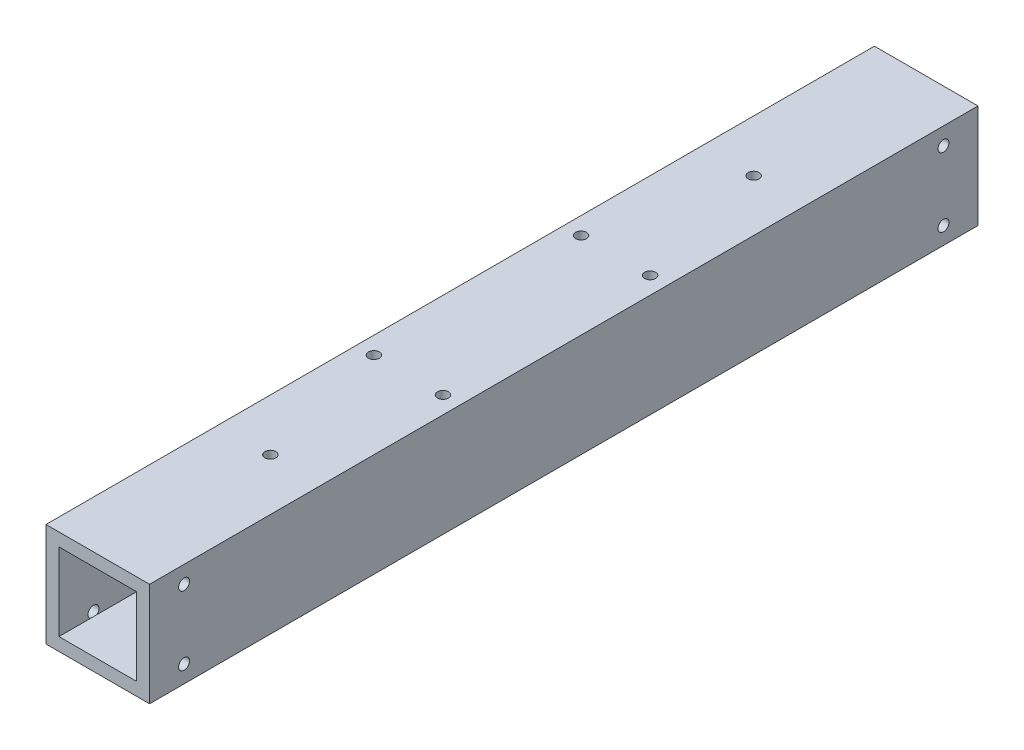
ISO-10303-21;
HEADER;
FILE_DESCRIPTION(('STEP AP214'),'2;1');
FILE_NAME('part.step','',(''),(''),'','','');
FILE_SCHEMA(('AUTOMOTIVE_DESIGN { 1 0 10303 214 1 1 1 1 }'));
ENDSEC;
DATA;
#1=APPLICATION_CONTEXT('core data for automotive mechanical design processes');
#2=APPLICATION_PROTOCOL_DEFINITION('international standard','automotive_design',2000,#1);
#3=PRODUCT_CONTEXT('',#1,'mechanical');
#4=PRODUCT('Part','Part','',(#3));
#5=PRODUCT_RELATED_PRODUCT_CATEGORY('part','',(#4));
#6=PRODUCT_DEFINITION_FORMATION('','',#4);
#7=PRODUCT_DEFINITION_CONTEXT('part definition',#1,'design');
#8=PRODUCT_DEFINITION('design','',#6,#7);
#9=PRODUCT_DEFINITION_SHAPE('','',#8);
#10=(LENGTH_UNIT() NAMED_UNIT(*) SI_UNIT(.MILLI.,.METRE.));
#11=(NAMED_UNIT(*) PLANE_ANGLE_UNIT() SI_UNIT($,.RADIAN.));
#12=(NAMED_UNIT(*) SI_UNIT($,.STERADIAN.) SOLID_ANGLE_UNIT());
#13=UNCERTAINTY_MEASURE_WITH_UNIT(LENGTH_MEASURE(1.E-05),#10,'distance_accuracy_value','');
#14=(GEOMETRIC_REPRESENTATION_CONTEXT(3) GLOBAL_UNCERTAINTY_ASSIGNED_CONTEXT((#13)) GLOBAL_UNIT_ASSIGNED_CONTEXT((#10,
#11,#12)) REPRESENTATION_CONTEXT('',''));
#15=CARTESIAN_POINT('',(0.,0.,0.));
#16=DIRECTION('',(0.,0.,1.));
#17=DIRECTION('',(1.,0.,0.));
#18=AXIS2_PLACEMENT_3D('',#15,#16,#17);
#19=CARTESIAN_POINT('',(0.,-19.05,0.));
#20=DIRECTION('',(0.,1.,0.));
#21=DIRECTION('',(0.,0.,1.));
#22=AXIS2_PLACEMENT_3D('',#19,#20,#21);
#23=PLANE('',#22);
#24=CARTESIAN_POINT('',(15.875,-19.05,-63.5));
#25=DIRECTION('',(0.,-1.,0.));
#26=DIRECTION('',(0.,0.,-1.));
#27=AXIS2_PLACEMENT_3D('',#24,#25,#26);
#28=CIRCLE('',#27,2.976626);
#29=CARTESIAN_POINT('',(15.875,-19.05,-66.476626));
#30=VERTEX_POINT('',#29);
#31=EDGE_CURVE('E212',#30,#30,#28,.T.);
#32=ORIENTED_EDGE('',*,*,#31,.F.);
#33=EDGE_LOOP('',(#32));
#34=FACE_BOUND('',#33,.T.);
#35=CARTESIAN_POINT('',(-15.875,-19.05,-63.5));
#36=DIRECTION('',(0.,-1.,0.));
#37=DIRECTION('',(0.,0.,-1.));
#38=AXIS2_PLACEMENT_3D('',#35,#36,#37);
#39=CIRCLE('',#38,2.976626);
#40=CARTESIAN_POINT('',(-15.875,-19.05,-66.476626));
#41=VERTEX_POINT('',#40);
#42=EDGE_CURVE('E223',#41,#41,#39,.T.);
#43=ORIENTED_EDGE('',*,*,#42,.F.);
#44=EDGE_LOOP('',(#43));
#45=FACE_BOUND('',#44,.T.);
#46=CARTESIAN_POINT('',(0.,-19.05,88.9));
#47=DIRECTION('',(0.,-1.,0.));
#48=DIRECTION('',(0.,0.,-1.));
#49=AXIS2_PLACEMENT_3D('',#46,#47,#48);
#50=CIRCLE('',#49,2.01929999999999);
#51=CARTESIAN_POINT('',(0.,-19.05,86.8807));
#52=VERTEX_POINT('',#51);
#53=EDGE_CURVE('E229',#52,#52,#50,.T.);
#54=ORIENTED_EDGE('',*,*,#53,.F.);
#55=EDGE_LOOP('',(#54));
#56=FACE_BOUND('',#55,.T.);
#57=CARTESIAN_POINT('',(0.,-19.05,-88.9));
#58=DIRECTION('',(0.,-1.,0.));
#59=DIRECTION('',(0.,0.,-1.));
#60=AXIS2_PLACEMENT_3D('',#57,#58,#59);
#61=CIRCLE('',#60,2.01929999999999);
#62=CARTESIAN_POINT('',(0.,-19.05,-90.9193));
#63=VERTEX_POINT('',#62);
#64=EDGE_CURVE('E235',#63,#63,#61,.T.);
#65=ORIENTED_EDGE('',*,*,#64,.F.);
#66=EDGE_LOOP('',(#65));
#67=FACE_BOUND('',#66,.T.);
#68=CARTESIAN_POINT('',(-10.16,-19.05,0.));
#69=DIRECTION('',(0.,-1.,0.));
#70=DIRECTION('',(0.,0.,-1.));
#71=AXIS2_PLACEMENT_3D('',#68,#69,#70);
#72=CIRCLE('',#71,2.2352);
#73=CARTESIAN_POINT('',(-10.16,-19.05,-2.2352));
#74=VERTEX_POINT('',#73);
#75=EDGE_CURVE('E256',#74,#74,#72,.T.);
#76=ORIENTED_EDGE('',*,*,#75,.F.);
#77=EDGE_LOOP('',(#76));
#78=FACE_BOUND('',#77,.T.);
#79=CARTESIAN_POINT('',(5.08,-19.05,-8.89));
#80=DIRECTION('',(0.,-1.,0.));
#81=DIRECTION('',(0.,0.,-1.));
#82=AXIS2_PLACEMENT_3D('',#79,#80,#81);
#83=CIRCLE('',#82,2.2352);
#84=CARTESIAN_POINT('',(5.08,-19.05,-11.1252));
#85=VERTEX_POINT('',#84);
#86=EDGE_CURVE('E262',#85,#85,#83,.T.);
#87=ORIENTED_EDGE('',*,*,#86,.F.);
#88=EDGE_LOOP('',(#87));
#89=FACE_BOUND('',#88,.T.);
#90=CARTESIAN_POINT('',(5.08,-19.05,8.89));
#91=DIRECTION('',(0.,-1.,0.));
#92=DIRECTION('',(0.,0.,-1.));
#93=AXIS2_PLACEMENT_3D('',#90,#91,#92);
#94=CIRCLE('',#93,2.2352);
#95=CARTESIAN_POINT('',(5.08,-19.05,6.6548));
#96=VERTEX_POINT('',#95);
#97=EDGE_CURVE('E268',#96,#96,#94,.T.);
#98=ORIENTED_EDGE('',*,*,#97,.F.);
#99=EDGE_LOOP('',(#98));
#100=FACE_BOUND('',#99,.T.);
#101=CARTESIAN_POINT('',(-12.7,-19.05,-38.1));
#102=DIRECTION('',(0.,-1.,0.));
#103=DIRECTION('',(0.,0.,-1.));
#104=AXIS2_PLACEMENT_3D('',#101,#102,#103);
#105=CIRCLE('',#104,2.01929999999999);
#106=CARTESIAN_POINT('',(-12.7,-19.05,-40.1193));
#107=VERTEX_POINT('',#106);
#108=EDGE_CURVE('E271',#107,#107,#105,.T.);
#109=ORIENTED_EDGE('',*,*,#108,.F.);
#110=EDGE_LOOP('',(#109));
#111=FACE_BOUND('',#110,.T.);
#112=CARTESIAN_POINT('',(12.7,-19.05,-38.1));
#113=DIRECTION('',(0.,-1.,0.));
#114=DIRECTION('',(0.,0.,-1.));
#115=AXIS2_PLACEMENT_3D('',#112,#113,#114);
#116=CIRCLE('',#115,2.01929999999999);
#117=CARTESIAN_POINT('',(12.7,-19.05,-40.1193));
#118=VERTEX_POINT('',#117);
#119=EDGE_CURVE('E275',#118,#118,#116,.T.);
#120=ORIENTED_EDGE('',*,*,#119,.F.);
#121=EDGE_LOOP('',(#120));
#122=FACE_BOUND('',#121,.T.);
#123=CARTESIAN_POINT('',(-12.7,-19.05,38.1));
#124=DIRECTION('',(0.,-1.,0.));
#125=DIRECTION('',(0.,0.,-1.));
#126=AXIS2_PLACEMENT_3D('',#123,#124,#125);
#127=CIRCLE('',#126,2.01929999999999);
#128=CARTESIAN_POINT('',(-12.7,-19.05,36.0807));
#129=VERTEX_POINT('',#128);
#130=EDGE_CURVE('E310',#129,#129,#127,.T.);
#131=ORIENTED_EDGE('',*,*,#130,.F.);
#132=EDGE_LOOP('',(#131));
#133=FACE_BOUND('',#132,.T.);
#134=CARTESIAN_POINT('',(12.7,-19.05,38.1));
#135=DIRECTION('',(0.,-1.,0.));
#136=DIRECTION('',(0.,0.,-1.));
#137=AXIS2_PLACEMENT_3D('',#134,#135,#136);
#138=CIRCLE('',#137,2.01929999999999);
#139=CARTESIAN_POINT('',(12.7,-19.05,36.0807));
#140=VERTEX_POINT('',#139);
#141=EDGE_CURVE('E315',#140,#140,#138,.T.);
#142=ORIENTED_EDGE('',*,*,#141,.F.);
#143=EDGE_LOOP('',(#142));
#144=FACE_BOUND('',#143,.T.);
#145=DIRECTION('',(0.,0.,1.));
#146=VECTOR('',#145,1.);
#147=CARTESIAN_POINT('',(-19.05,-19.05,-152.4));
#148=LINE('',#147,#146);
#149=CARTESIAN_POINT('',(-19.05,-19.05,-152.4));
#150=VERTEX_POINT('',#149);
#151=CARTESIAN_POINT('',(-19.05,-19.05,152.4));
#152=VERTEX_POINT('',#151);
#153=EDGE_CURVE('E382',#150,#152,#148,.T.);
#154=ORIENTED_EDGE('',*,*,#153,.F.);
#155=DIRECTION('',(-1.,0.,0.));
#156=VECTOR('',#155,1.);
#157=CARTESIAN_POINT('',(-19.05,-19.05,-152.4));
#158=LINE('',#157,#156);
#159=CARTESIAN_POINT('',(19.05,-19.05,-152.4));
#160=VERTEX_POINT('',#159);
#161=EDGE_CURVE('E411',#160,#150,#158,.T.);
#162=ORIENTED_EDGE('',*,*,#161,.F.);
#163=DIRECTION('',(0.,0.,-1.));
#164=VECTOR('',#163,1.);
#165=CARTESIAN_POINT('',(19.05,-19.05,-152.4));
#166=LINE('',#165,#164);
#167=CARTESIAN_POINT('',(19.05,-19.05,152.4));
#168=VERTEX_POINT('',#167);
#169=EDGE_CURVE('E422',#168,#160,#166,.T.);
#170=ORIENTED_EDGE('',*,*,#169,.F.);
#171=DIRECTION('',(1.,0.,0.));
#172=VECTOR('',#171,1.);
#173=CARTESIAN_POINT('',(-19.05,-19.05,152.4));
#174=LINE('',#173,#172);
#175=EDGE_CURVE('E420',#152,#168,#174,.T.);
#176=ORIENTED_EDGE('',*,*,#175,.F.);
#177=EDGE_LOOP('',(#154,#162,#170,#176));
#178=FACE_BOUND('',#177,.T.);
#179=CARTESIAN_POINT('',(0.,-19.05,63.5));
#180=DIRECTION('',(0.,-1.,0.));
#181=DIRECTION('',(0.,0.,-1.));
#182=AXIS2_PLACEMENT_3D('',#179,#180,#181);
#183=CIRCLE('',#182,2.976626);
#184=CARTESIAN_POINT('',(0.,-19.05,60.523374));
#185=VERTEX_POINT('',#184);
#186=EDGE_CURVE('E213',#185,#185,#183,.T.);
#187=ORIENTED_EDGE('',*,*,#186,.F.);
#188=EDGE_LOOP('',(#187));
#189=FACE_BOUND('',#188,.T.);
#190=ADVANCED_FACE('F34',(#34,#45,#56,#67,#78,#89,#100,#111,#122,#133,#144,#178,#189),#23,.F.);
#191=CARTESIAN_POINT('',(-19.05,19.05,-152.4));
#192=DIRECTION('',(1.,0.,0.));
#193=DIRECTION('',(0.,0.,-1.));
#194=AXIS2_PLACEMENT_3D('',#191,#192,#193);
#195=PLANE('',#194);
#196=CARTESIAN_POINT('',(-19.05,12.7,-139.7));
#197=DIRECTION('',(-1.,0.,0.));
#198=DIRECTION('',(0.,0.,1.));
#199=AXIS2_PLACEMENT_3D('',#196,#197,#198);
#200=CIRCLE('',#199,2.01929999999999);
#201=CARTESIAN_POINT('',(-19.05,12.7,-137.6807));
#202=VERTEX_POINT('',#201);
#203=EDGE_CURVE('E279',#202,#202,#200,.T.);
#204=ORIENTED_EDGE('',*,*,#203,.F.);
#205=EDGE_LOOP('',(#204));
#206=FACE_BOUND('',#205,.T.);
#207=CARTESIAN_POINT('',(-19.05,-12.7,-139.7));
#208=DIRECTION('',(-1.,0.,0.));
#209=DIRECTION('',(0.,0.,1.));
#210=AXIS2_PLACEMENT_3D('',#207,#208,#209);
#211=CIRCLE('',#210,2.01929999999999);
#212=CARTESIAN_POINT('',(-19.05,-12.7,-137.6807));
#213=VERTEX_POINT('',#212);
#214=EDGE_CURVE('E284',#213,#213,#211,.T.);
#215=ORIENTED_EDGE('',*,*,#214,.F.);
#216=EDGE_LOOP('',(#215));
#217=FACE_BOUND('',#216,.T.);
#218=CARTESIAN_POINT('',(-19.05,12.7,139.7));
#219=DIRECTION('',(-1.,0.,0.));
#220=DIRECTION('',(0.,0.,1.));
#221=AXIS2_PLACEMENT_3D('',#218,#219,#220);
#222=CIRCLE('',#221,2.01929999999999);
#223=CARTESIAN_POINT('',(-19.05,12.7,141.7193));
#224=VERTEX_POINT('',#223);
#225=EDGE_CURVE('E321',#224,#224,#222,.T.);
#226=ORIENTED_EDGE('',*,*,#225,.F.);
#227=EDGE_LOOP('',(#226));
#228=FACE_BOUND('',#227,.T.);
#229=CARTESIAN_POINT('',(-19.05,-12.7,139.7));
#230=DIRECTION('',(-1.,0.,0.));
#231=DIRECTION('',(0.,0.,1.));
#232=AXIS2_PLACEMENT_3D('',#229,#230,#231);
#233=CIRCLE('',#232,2.01929999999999);
#234=CARTESIAN_POINT('',(-19.05,-12.7,141.7193));
#235=VERTEX_POINT('',#234);
#236=EDGE_CURVE('E326',#235,#235,#233,.T.);
#237=ORIENTED_EDGE('',*,*,#236,.F.);
#238=EDGE_LOOP('',(#237));
#239=FACE_BOUND('',#238,.T.);
#240=ORIENTED_EDGE('',*,*,#153,.T.);
#241=DIRECTION('',(0.,-1.,0.));
#242=VECTOR('',#241,1.);
#243=CARTESIAN_POINT('',(-19.05,19.05,152.4));
#244=LINE('',#243,#242);
#245=CARTESIAN_POINT('',(-19.05,19.05,152.4));
#246=VERTEX_POINT('',#245);
#247=EDGE_CURVE('E433',#246,#152,#244,.T.);
#248=ORIENTED_EDGE('',*,*,#247,.F.);
#249=DIRECTION('',(0.,0.,1.));
#250=VECTOR('',#249,1.);
#251=CARTESIAN_POINT('',(-19.05,19.05,-152.4));
#252=LINE('',#251,#250);
#253=CARTESIAN_POINT('',(-19.05,19.05,-152.4));
#254=VERTEX_POINT('',#253);
#255=EDGE_CURVE('E407',#254,#246,#252,.T.);
#256=ORIENTED_EDGE('',*,*,#255,.F.);
#257=DIRECTION('',(0.,-1.,0.));
#258=VECTOR('',#257,1.);
#259=CARTESIAN_POINT('',(-19.05,19.05,-152.4));
#260=LINE('',#259,#258);
#261=EDGE_CURVE('E417',#254,#150,#260,.T.);
#262=ORIENTED_EDGE('',*,*,#261,.T.);
#263=EDGE_LOOP('',(#240,#248,#256,#262));
#264=FACE_BOUND('',#263,.T.);
#265=ADVANCED_FACE('F36',(#206,#217,#228,#239,#264),#195,.F.);
#266=CARTESIAN_POINT('',(-19.05,19.05,152.4));
#267=DIRECTION('',(0.,0.,-1.));
#268=DIRECTION('',(-1.,0.,0.));
#269=AXIS2_PLACEMENT_3D('',#266,#267,#268);
#270=PLANE('',#269);
#271=DIRECTION('',(1.,0.,0.));
#272=VECTOR('',#271,1.);
#273=CARTESIAN_POINT('',(-14.2875,-14.2875,152.4));
#274=LINE('',#273,#272);
#275=CARTESIAN_POINT('',(-14.2875,-14.2875,152.4));
#276=VERTEX_POINT('',#275);
#277=CARTESIAN_POINT('',(14.2875,-14.2875,152.4));
#278=VERTEX_POINT('',#277);
#279=EDGE_CURVE('E371',#276,#278,#274,.T.);
#280=ORIENTED_EDGE('',*,*,#279,.F.);
#281=DIRECTION('',(0.,-1.,0.));
#282=VECTOR('',#281,1.);
#283=CARTESIAN_POINT('',(-14.2875,14.2875,152.4));
#284=LINE('',#283,#282);
#285=CARTESIAN_POINT('',(-14.2875,14.2875,152.4));
#286=VERTEX_POINT('',#285);
#287=EDGE_CURVE('E354',#286,#276,#284,.T.);
#288=ORIENTED_EDGE('',*,*,#287,.F.);
#289=DIRECTION('',(-1.,0.,0.));
#290=VECTOR('',#289,1.);
#291=CARTESIAN_POINT('',(-14.2875,14.2875,152.4));
#292=LINE('',#291,#290);
#293=CARTESIAN_POINT('',(14.2875,14.2875,152.4));
#294=VERTEX_POINT('',#293);
#295=EDGE_CURVE('E359',#294,#286,#292,.T.);
#296=ORIENTED_EDGE('',*,*,#295,.F.);
#297=DIRECTION('',(0.,1.,0.));
#298=VECTOR('',#297,1.);
#299=CARTESIAN_POINT('',(14.2875,14.2875,152.4));
#300=LINE('',#299,#298);
#301=EDGE_CURVE('E374',#278,#294,#300,.T.);
#302=ORIENTED_EDGE('',*,*,#301,.F.);
#303=EDGE_LOOP('',(#280,#288,#296,#302));
#304=FACE_BOUND('',#303,.T.);
#305=ORIENTED_EDGE('',*,*,#175,.T.);
#306=DIRECTION('',(0.,-1.,0.));
#307=VECTOR('',#306,1.);
#308=CARTESIAN_POINT('',(19.05,19.05,152.4));
#309=LINE('',#308,#307);
#310=CARTESIAN_POINT('',(19.05,19.05,152.4));
#311=VERTEX_POINT('',#310);
#312=EDGE_CURVE('E430',#311,#168,#309,.T.);
#313=ORIENTED_EDGE('',*,*,#312,.F.);
#314=DIRECTION('',(1.,0.,0.));
#315=VECTOR('',#314,1.);
#316=CARTESIAN_POINT('',(-19.05,19.05,152.4));
#317=LINE('',#316,#315);
#318=EDGE_CURVE('E410',#246,#311,#317,.T.);
#319=ORIENTED_EDGE('',*,*,#318,.F.);
#320=ORIENTED_EDGE('',*,*,#247,.T.);
#321=EDGE_LOOP('',(#305,#313,#319,#320));
#322=FACE_BOUND('',#321,.T.);
#323=ADVANCED_FACE('F512',(#304,#322),#270,.F.);
#324=CARTESIAN_POINT('',(19.05,19.05,-152.4));
#325=DIRECTION('',(-1.,0.,0.));
#326=DIRECTION('',(0.,0.,1.));
#327=AXIS2_PLACEMENT_3D('',#324,#325,#326);
#328=PLANE('',#327);
#329=CARTESIAN_POINT('',(19.05,12.7,-139.7));
#330=DIRECTION('',(1.,0.,0.));
#331=DIRECTION('',(0.,0.,-1.));
#332=AXIS2_PLACEMENT_3D('',#329,#330,#331);
#333=CIRCLE('',#332,2.01929999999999);
#334=CARTESIAN_POINT('',(19.05,12.7,-141.7193));
#335=VERTEX_POINT('',#334);
#336=EDGE_CURVE('E300',#335,#335,#333,.T.);
#337=ORIENTED_EDGE('',*,*,#336,.F.);
#338=EDGE_LOOP('',(#337));
#339=FACE_BOUND('',#338,.T.);
#340=CARTESIAN_POINT('',(19.05,-12.7,-139.7));
#341=DIRECTION('',(1.,0.,0.));
#342=DIRECTION('',(0.,0.,-1.));
#343=AXIS2_PLACEMENT_3D('',#340,#341,#342);
#344=CIRCLE('',#343,2.01929999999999);
#345=CARTESIAN_POINT('',(19.05,-12.7,-141.7193));
#346=VERTEX_POINT('',#345);
#347=EDGE_CURVE('E305',#346,#346,#344,.T.);
#348=ORIENTED_EDGE('',*,*,#347,.F.);
#349=EDGE_LOOP('',(#348));
#350=FACE_BOUND('',#349,.T.);
#351=CARTESIAN_POINT('',(19.05,12.7,139.7));
#352=DIRECTION('',(1.,0.,0.));
#353=DIRECTION('',(0.,0.,-1.));
#354=AXIS2_PLACEMENT_3D('',#351,#352,#353);
#355=CIRCLE('',#354,2.01929999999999);
#356=CARTESIAN_POINT('',(19.05,12.7,137.6807));
#357=VERTEX_POINT('',#356);
#358=EDGE_CURVE('E343',#357,#357,#355,.T.);
#359=ORIENTED_EDGE('',*,*,#358,.F.);
#360=EDGE_LOOP('',(#359));
#361=FACE_BOUND('',#360,.T.);
#362=CARTESIAN_POINT('',(19.05,-12.7,139.7));
#363=DIRECTION('',(1.,0.,0.));
#364=DIRECTION('',(0.,0.,-1.));
#365=AXIS2_PLACEMENT_3D('',#362,#363,#364);
#366=CIRCLE('',#365,2.01929999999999);
#367=CARTESIAN_POINT('',(19.05,-12.7,137.6807));
#368=VERTEX_POINT('',#367);
#369=EDGE_CURVE('E349',#368,#368,#366,.T.);
#370=ORIENTED_EDGE('',*,*,#369,.F.);
#371=EDGE_LOOP('',(#370));
#372=FACE_BOUND('',#371,.T.);
#373=ORIENTED_EDGE('',*,*,#169,.T.);
#374=DIRECTION('',(0.,-1.,0.));
#375=VECTOR('',#374,1.);
#376=CARTESIAN_POINT('',(19.05,19.05,-152.4));
#377=LINE('',#376,#375);
#378=CARTESIAN_POINT('',(19.05,19.05,-152.4));
#379=VERTEX_POINT('',#378);
#380=EDGE_CURVE('E427',#379,#160,#377,.T.);
#381=ORIENTED_EDGE('',*,*,#380,.F.);
#382=DIRECTION('',(0.,0.,-1.));
#383=VECTOR('',#382,1.);
#384=CARTESIAN_POINT('',(19.05,19.05,-152.4));
#385=LINE('',#384,#383);
#386=EDGE_CURVE('E413',#311,#379,#385,.T.);
#387=ORIENTED_EDGE('',*,*,#386,.F.);
#388=ORIENTED_EDGE('',*,*,#312,.T.);
#389=EDGE_LOOP('',(#373,#381,#387,#388));
#390=FACE_BOUND('',#389,.T.);
#391=ADVANCED_FACE('F572',(#339,#350,#361,#372,#390),#328,.F.);
#392=CARTESIAN_POINT('',(-19.05,19.05,-152.4));
#393=DIRECTION('',(0.,0.,1.));
#394=DIRECTION('',(1.,0.,0.));
#395=AXIS2_PLACEMENT_3D('',#392,#393,#394);
#396=PLANE('',#395);
#397=DIRECTION('',(-1.,0.,0.));
#398=VECTOR('',#397,1.);
#399=CARTESIAN_POINT('',(-14.2875,14.2875,-152.4));
#400=LINE('',#399,#398);
#401=CARTESIAN_POINT('',(14.2875,14.2875,-152.4));
#402=VERTEX_POINT('',#401);
#403=CARTESIAN_POINT('',(-14.2875,14.2875,-152.4));
#404=VERTEX_POINT('',#403);
#405=EDGE_CURVE('E365',#402,#404,#400,.T.);
#406=ORIENTED_EDGE('',*,*,#405,.T.);
#407=DIRECTION('',(0.,-1.,0.));
#408=VECTOR('',#407,1.);
#409=CARTESIAN_POINT('',(-14.2875,14.2875,-152.4));
#410=LINE('',#409,#408);
#411=CARTESIAN_POINT('',(-14.2875,-14.2875,-152.4));
#412=VERTEX_POINT('',#411);
#413=EDGE_CURVE('E355',#404,#412,#410,.T.);
#414=ORIENTED_EDGE('',*,*,#413,.T.);
#415=DIRECTION('',(1.,0.,0.));
#416=VECTOR('',#415,1.);
#417=CARTESIAN_POINT('',(-14.2875,-14.2875,-152.4));
#418=LINE('',#417,#416);
#419=CARTESIAN_POINT('',(14.2875,-14.2875,-152.4));
#420=VERTEX_POINT('',#419);
#421=EDGE_CURVE('E358',#412,#420,#418,.T.);
#422=ORIENTED_EDGE('',*,*,#421,.T.);
#423=DIRECTION('',(0.,1.,0.));
#424=VECTOR('',#423,1.);
#425=CARTESIAN_POINT('',(14.2875,14.2875,-152.4));
#426=LINE('',#425,#424);
#427=EDGE_CURVE('E362',#420,#402,#426,.T.);
#428=ORIENTED_EDGE('',*,*,#427,.T.);
#429=EDGE_LOOP('',(#406,#414,#422,#428));
#430=FACE_BOUND('',#429,.T.);
#431=ORIENTED_EDGE('',*,*,#161,.T.);
#432=ORIENTED_EDGE('',*,*,#261,.F.);
#433=DIRECTION('',(-1.,0.,0.));
#434=VECTOR('',#433,1.);
#435=CARTESIAN_POINT('',(-19.05,19.05,-152.4));
#436=LINE('',#435,#434);
#437=EDGE_CURVE('E415',#379,#254,#436,.T.);
#438=ORIENTED_EDGE('',*,*,#437,.F.);
#439=ORIENTED_EDGE('',*,*,#380,.T.);
#440=EDGE_LOOP('',(#431,#432,#438,#439));
#441=FACE_BOUND('',#440,.T.);
#442=ADVANCED_FACE('F569',(#430,#441),#396,.F.);
#443=CARTESIAN_POINT('',(0.,19.05,0.));
#444=DIRECTION('',(0.,1.,0.));
#445=DIRECTION('',(0.,0.,1.));
#446=AXIS2_PLACEMENT_3D('',#443,#444,#445);
#447=PLANE('',#446);
#448=CARTESIAN_POINT('',(0.,19.05,88.9));
#449=DIRECTION('',(0.,1.,0.));
#450=DIRECTION('',(0.,0.,1.));
#451=AXIS2_PLACEMENT_3D('',#448,#449,#450);
#452=CIRCLE('',#451,2.01929999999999);
#453=CARTESIAN_POINT('',(0.,19.05,90.9193));
#454=VERTEX_POINT('',#453);
#455=EDGE_CURVE('E241',#454,#454,#452,.T.);
#456=ORIENTED_EDGE('',*,*,#455,.F.);
#457=EDGE_LOOP('',(#456));
#458=FACE_BOUND('',#457,.T.);
#459=CARTESIAN_POINT('',(0.,19.05,-88.9));
#460=DIRECTION('',(0.,1.,0.));
#461=DIRECTION('',(0.,0.,1.));
#462=AXIS2_PLACEMENT_3D('',#459,#460,#461);
#463=CIRCLE('',#462,2.01929999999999);
#464=CARTESIAN_POINT('',(0.,19.05,-86.8807));
#465=VERTEX_POINT('',#464);
#466=EDGE_CURVE('E247',#465,#465,#463,.T.);
#467=ORIENTED_EDGE('',*,*,#466,.F.);
#468=EDGE_LOOP('',(#467));
#469=FACE_BOUND('',#468,.T.);
#470=CARTESIAN_POINT('',(-12.7,19.05,-38.1));
#471=DIRECTION('',(0.,1.,0.));
#472=DIRECTION('',(0.,0.,1.));
#473=AXIS2_PLACEMENT_3D('',#470,#471,#472);
#474=CIRCLE('',#473,2.01929999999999);
#475=CARTESIAN_POINT('',(-12.7,19.05,-36.0807));
#476=VERTEX_POINT('',#475);
#477=EDGE_CURVE('E289',#476,#476,#474,.T.);
#478=ORIENTED_EDGE('',*,*,#477,.F.);
#479=EDGE_LOOP('',(#478));
#480=FACE_BOUND('',#479,.T.);
#481=CARTESIAN_POINT('',(12.7,19.05,-38.1));
#482=DIRECTION('',(0.,1.,0.));
#483=DIRECTION('',(0.,0.,1.));
#484=AXIS2_PLACEMENT_3D('',#481,#482,#483);
#485=CIRCLE('',#484,2.01929999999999);
#486=CARTESIAN_POINT('',(12.7,19.05,-36.0807));
#487=VERTEX_POINT('',#486);
#488=EDGE_CURVE('E295',#487,#487,#485,.T.);
#489=ORIENTED_EDGE('',*,*,#488,.F.);
#490=EDGE_LOOP('',(#489));
#491=FACE_BOUND('',#490,.T.);
#492=CARTESIAN_POINT('',(-12.7,19.05,38.1));
#493=DIRECTION('',(0.,1.,0.));
#494=DIRECTION('',(0.,0.,1.));
#495=AXIS2_PLACEMENT_3D('',#492,#493,#494);
#496=CIRCLE('',#495,2.01929999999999);
#497=CARTESIAN_POINT('',(-12.7,19.05,40.1193));
#498=VERTEX_POINT('',#497);
#499=EDGE_CURVE('E332',#498,#498,#496,.T.);
#500=ORIENTED_EDGE('',*,*,#499,.F.);
#501=EDGE_LOOP('',(#500));
#502=FACE_BOUND('',#501,.T.);
#503=CARTESIAN_POINT('',(12.7,19.05,38.1));
#504=DIRECTION('',(0.,1.,0.));
#505=DIRECTION('',(0.,0.,1.));
#506=AXIS2_PLACEMENT_3D('',#503,#504,#505);
#507=CIRCLE('',#506,2.01929999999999);
#508=CARTESIAN_POINT('',(12.7,19.05,40.1193));
#509=VERTEX_POINT('',#508);
#510=EDGE_CURVE('E338',#509,#509,#507,.T.);
#511=ORIENTED_EDGE('',*,*,#510,.F.);
#512=EDGE_LOOP('',(#511));
#513=FACE_BOUND('',#512,.T.);
#514=ORIENTED_EDGE('',*,*,#255,.T.);
#515=ORIENTED_EDGE('',*,*,#318,.T.);
#516=ORIENTED_EDGE('',*,*,#386,.T.);
#517=ORIENTED_EDGE('',*,*,#437,.T.);
#518=EDGE_LOOP('',(#514,#515,#516,#517));
#519=FACE_BOUND('',#518,.T.);
#520=ADVANCED_FACE('F567',(#458,#469,#480,#491,#502,#513,#519),#447,.T.);
#521=CARTESIAN_POINT('',(-14.2875,14.2875,-152.4));
#522=DIRECTION('',(-1.,0.,0.));
#523=DIRECTION('',(0.,-1.,0.));
#524=AXIS2_PLACEMENT_3D('',#521,#522,#523);
#525=PLANE('',#524);
#526=DIRECTION('',(0.,0.,1.));
#527=VECTOR('',#526,1.);
#528=CARTESIAN_POINT('',(-14.2875,14.2875,-152.4));
#529=LINE('',#528,#527);
#530=CARTESIAN_POINT('',(-14.2875,14.2875,-140.947964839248));
#531=VERTEX_POINT('',#530);
#532=EDGE_CURVE('E379',#404,#531,#529,.T.);
#533=ORIENTED_EDGE('',*,*,#532,.T.);
#534=CARTESIAN_POINT('',(-14.2875,12.7,-139.7));
#535=DIRECTION('',(-1.,0.,0.));
#536=DIRECTION('',(0.,-1.,0.));
#537=AXIS2_PLACEMENT_3D('',#534,#535,#536);
#538=CIRCLE('',#537,2.01929999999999);
#539=CARTESIAN_POINT('',(-14.2875,14.2875,-138.452035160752));
#540=VERTEX_POINT('',#539);
#541=EDGE_CURVE('E475',#531,#540,#538,.T.);
#542=ORIENTED_EDGE('',*,*,#541,.T.);
#543=CARTESIAN_POINT('',(-14.2875,14.2875,-39.3479648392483));
#544=VERTEX_POINT('',#543);
#545=EDGE_CURVE('E384',#540,#544,#529,.T.);
#546=ORIENTED_EDGE('',*,*,#545,.T.);
#547=CARTESIAN_POINT('',(-14.2875,14.2875,-36.8520351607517));
#548=VERTEX_POINT('',#547);
#549=EDGE_CURVE('E1076',#544,#548,#529,.T.);
#550=ORIENTED_EDGE('',*,*,#549,.T.);
#551=CARTESIAN_POINT('',(-14.2875,14.2875,36.8520351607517));
#552=VERTEX_POINT('',#551);
#553=EDGE_CURVE('E1080',#548,#552,#529,.T.);
#554=ORIENTED_EDGE('',*,*,#553,.T.);
#555=CARTESIAN_POINT('',(-14.2875,14.2875,39.3479648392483));
#556=VERTEX_POINT('',#555);
#557=EDGE_CURVE('E385',#552,#556,#529,.T.);
#558=ORIENTED_EDGE('',*,*,#557,.T.);
#559=CARTESIAN_POINT('',(-14.2875,14.2875,138.452035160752));
#560=VERTEX_POINT('',#559);
#561=EDGE_CURVE('E1078',#556,#560,#529,.T.);
#562=ORIENTED_EDGE('',*,*,#561,.T.);
#563=CARTESIAN_POINT('',(-14.2875,12.7,139.7));
#564=DIRECTION('',(-1.,0.,0.));
#565=DIRECTION('',(0.,-1.,0.));
#566=AXIS2_PLACEMENT_3D('',#563,#564,#565);
#567=CIRCLE('',#566,2.01929999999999);
#568=CARTESIAN_POINT('',(-14.2875,14.2875,140.947964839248));
#569=VERTEX_POINT('',#568);
#570=EDGE_CURVE('E451',#560,#569,#567,.T.);
#571=ORIENTED_EDGE('',*,*,#570,.T.);
#572=EDGE_CURVE('E389',#569,#286,#529,.T.);
#573=ORIENTED_EDGE('',*,*,#572,.T.);
#574=ORIENTED_EDGE('',*,*,#287,.T.);
#575=DIRECTION('',(0.,0.,1.));
#576=VECTOR('',#575,1.);
#577=CARTESIAN_POINT('',(-14.2875,-14.2875,-152.4));
#578=LINE('',#577,#576);
#579=CARTESIAN_POINT('',(-14.2875,-14.2875,140.947964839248));
#580=VERTEX_POINT('',#579);
#581=EDGE_CURVE('E368',#580,#276,#578,.T.);
#582=ORIENTED_EDGE('',*,*,#581,.F.);
#583=CARTESIAN_POINT('',(-14.2875,-12.7,139.7));
#584=DIRECTION('',(-1.,0.,0.));
#585=DIRECTION('',(0.,-1.,0.));
#586=AXIS2_PLACEMENT_3D('',#583,#584,#585);
#587=CIRCLE('',#586,2.01929999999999);
#588=CARTESIAN_POINT('',(-14.2875,-14.2875,138.452035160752));
#589=VERTEX_POINT('',#588);
#590=EDGE_CURVE('E448',#580,#589,#587,.T.);
#591=ORIENTED_EDGE('',*,*,#590,.T.);
#592=CARTESIAN_POINT('',(-14.2875,-14.2875,39.3479648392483));
#593=VERTEX_POINT('',#592);
#594=EDGE_CURVE('E1045',#593,#589,#578,.T.);
#595=ORIENTED_EDGE('',*,*,#594,.F.);
#596=CARTESIAN_POINT('',(-14.2875,-14.2875,36.8520351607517));
#597=VERTEX_POINT('',#596);
#598=EDGE_CURVE('E1047',#597,#593,#578,.T.);
#599=ORIENTED_EDGE('',*,*,#598,.F.);
#600=CARTESIAN_POINT('',(-14.2875,-14.2875,-36.8520351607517));
#601=VERTEX_POINT('',#600);
#602=EDGE_CURVE('E405',#601,#597,#578,.T.);
#603=ORIENTED_EDGE('',*,*,#602,.F.);
#604=CARTESIAN_POINT('',(-14.2875,-14.2875,-39.3479648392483));
#605=VERTEX_POINT('',#604);
#606=EDGE_CURVE('E1046',#605,#601,#578,.T.);
#607=ORIENTED_EDGE('',*,*,#606,.F.);
#608=CARTESIAN_POINT('',(-14.2875,-14.2875,-138.452035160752));
#609=VERTEX_POINT('',#608);
#610=EDGE_CURVE('E1042',#609,#605,#578,.T.);
#611=ORIENTED_EDGE('',*,*,#610,.F.);
#612=CARTESIAN_POINT('',(-14.2875,-12.7,-139.7));
#613=DIRECTION('',(-1.,0.,0.));
#614=DIRECTION('',(0.,-1.,0.));
#615=AXIS2_PLACEMENT_3D('',#612,#613,#614);
#616=CIRCLE('',#615,2.01929999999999);
#617=CARTESIAN_POINT('',(-14.2875,-14.2875,-140.947964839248));
#618=VERTEX_POINT('',#617);
#619=EDGE_CURVE('E472',#609,#618,#616,.T.);
#620=ORIENTED_EDGE('',*,*,#619,.T.);
#621=EDGE_CURVE('E400',#412,#618,#578,.T.);
#622=ORIENTED_EDGE('',*,*,#621,.F.);
#623=ORIENTED_EDGE('',*,*,#413,.F.);
#624=EDGE_LOOP('',(#533,#542,#546,#550,#554,#558,#562,#571,#573,#574,#582,#591,#595,#599,#603,
#607,#611,#620,#622,#623));
#625=FACE_BOUND('',#624,.T.);
#626=ADVANCED_FACE('F597',(#625),#525,.F.);
#627=CARTESIAN_POINT('',(-14.2875,14.2875,-152.4));
#628=DIRECTION('',(0.,1.,0.));
#629=DIRECTION('',(0.,0.,1.));
#630=AXIS2_PLACEMENT_3D('',#627,#628,#629);
#631=PLANE('',#630);
#632=CARTESIAN_POINT('',(0.,14.2875,88.9));
#633=DIRECTION('',(0.,1.,0.));
#634=DIRECTION('',(0.,0.,1.));
#635=AXIS2_PLACEMENT_3D('',#632,#633,#634);
#636=CIRCLE('',#635,2.01929999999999);
#637=CARTESIAN_POINT('',(0.,14.2875,90.9193));
#638=VERTEX_POINT('',#637);
#639=EDGE_CURVE('E244',#638,#638,#636,.T.);
#640=ORIENTED_EDGE('',*,*,#639,.T.);
#641=EDGE_LOOP('',(#640));
#642=FACE_BOUND('',#641,.T.);
#643=CARTESIAN_POINT('',(0.,14.2875,-88.9));
#644=DIRECTION('',(0.,1.,0.));
#645=DIRECTION('',(0.,0.,1.));
#646=AXIS2_PLACEMENT_3D('',#643,#644,#645);
#647=CIRCLE('',#646,2.01929999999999);
#648=CARTESIAN_POINT('',(0.,14.2875,-86.8807));
#649=VERTEX_POINT('',#648);
#650=EDGE_CURVE('E250',#649,#649,#647,.T.);
#651=ORIENTED_EDGE('',*,*,#650,.T.);
#652=EDGE_LOOP('',(#651));
#653=FACE_BOUND('',#652,.T.);
#654=ORIENTED_EDGE('',*,*,#553,.F.);
#655=CARTESIAN_POINT('',(-12.7,14.2875,-38.1));
#656=DIRECTION('',(0.,1.,0.));
#657=DIRECTION('',(0.,0.,1.));
#658=AXIS2_PLACEMENT_3D('',#655,#656,#657);
#659=CIRCLE('',#658,2.01929999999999);
#660=EDGE_CURVE('E469',#548,#544,#659,.T.);
#661=ORIENTED_EDGE('',*,*,#660,.T.);
#662=ORIENTED_EDGE('',*,*,#545,.F.);
#663=EDGE_CURVE('E383',#531,#540,#529,.T.);
#664=ORIENTED_EDGE('',*,*,#663,.F.);
#665=ORIENTED_EDGE('',*,*,#532,.F.);
#666=ORIENTED_EDGE('',*,*,#405,.F.);
#667=DIRECTION('',(0.,0.,1.));
#668=VECTOR('',#667,1.);
#669=CARTESIAN_POINT('',(14.2875,14.2875,-152.4));
#670=LINE('',#669,#668);
#671=CARTESIAN_POINT('',(14.2875,14.2875,-140.947964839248));
#672=VERTEX_POINT('',#671);
#673=EDGE_CURVE('E386',#402,#672,#670,.T.);
#674=ORIENTED_EDGE('',*,*,#673,.T.);
#675=CARTESIAN_POINT('',(14.2875,14.2875,-138.452035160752));
#676=VERTEX_POINT('',#675);
#677=EDGE_CURVE('E390',#672,#676,#670,.T.);
#678=ORIENTED_EDGE('',*,*,#677,.T.);
#679=CARTESIAN_POINT('',(14.2875,14.2875,-39.3479648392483));
#680=VERTEX_POINT('',#679);
#681=EDGE_CURVE('E527',#676,#680,#670,.T.);
#682=ORIENTED_EDGE('',*,*,#681,.T.);
#683=CARTESIAN_POINT('',(12.7,14.2875,-38.1));
#684=DIRECTION('',(0.,1.,0.));
#685=DIRECTION('',(0.,0.,1.));
#686=AXIS2_PLACEMENT_3D('',#683,#684,#685);
#687=CIRCLE('',#686,2.01929999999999);
#688=CARTESIAN_POINT('',(14.2875,14.2875,-36.8520351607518));
#689=VERTEX_POINT('',#688);
#690=EDGE_CURVE('E466',#680,#689,#687,.T.);
#691=ORIENTED_EDGE('',*,*,#690,.T.);
#692=CARTESIAN_POINT('',(14.2875,14.2875,36.8520351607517));
#693=VERTEX_POINT('',#692);
#694=EDGE_CURVE('E391',#689,#693,#670,.T.);
#695=ORIENTED_EDGE('',*,*,#694,.T.);
#696=CARTESIAN_POINT('',(12.7,14.2875,38.1));
#697=DIRECTION('',(0.,1.,0.));
#698=DIRECTION('',(0.,0.,1.));
#699=AXIS2_PLACEMENT_3D('',#696,#697,#698);
#700=CIRCLE('',#699,2.01929999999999);
#701=CARTESIAN_POINT('',(14.2875,14.2875,39.3479648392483));
#702=VERTEX_POINT('',#701);
#703=EDGE_CURVE('E442',#693,#702,#700,.T.);
#704=ORIENTED_EDGE('',*,*,#703,.T.);
#705=CARTESIAN_POINT('',(14.2875,14.2875,138.452035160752));
#706=VERTEX_POINT('',#705);
#707=EDGE_CURVE('E522',#702,#706,#670,.T.);
#708=ORIENTED_EDGE('',*,*,#707,.T.);
#709=CARTESIAN_POINT('',(14.2875,14.2875,140.947964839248));
#710=VERTEX_POINT('',#709);
#711=EDGE_CURVE('E392',#706,#710,#670,.T.);
#712=ORIENTED_EDGE('',*,*,#711,.T.);
#713=EDGE_CURVE('E396',#710,#294,#670,.T.);
#714=ORIENTED_EDGE('',*,*,#713,.T.);
#715=ORIENTED_EDGE('',*,*,#295,.T.);
#716=ORIENTED_EDGE('',*,*,#572,.F.);
#717=EDGE_CURVE('E1075',#560,#569,#529,.T.);
#718=ORIENTED_EDGE('',*,*,#717,.F.);
#719=ORIENTED_EDGE('',*,*,#561,.F.);
#720=CARTESIAN_POINT('',(-12.7,14.2875,38.1));
#721=DIRECTION('',(0.,1.,0.));
#722=DIRECTION('',(0.,0.,1.));
#723=AXIS2_PLACEMENT_3D('',#720,#721,#722);
#724=CIRCLE('',#723,2.01929999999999);
#725=EDGE_CURVE('E445',#556,#552,#724,.T.);
#726=ORIENTED_EDGE('',*,*,#725,.T.);
#727=EDGE_LOOP('',(#654,#661,#662,#664,#665,#666,#674,#678,#682,#691,#695,#704,#708,#712,#714,
#715,#716,#718,#719,#726));
#728=FACE_BOUND('',#727,.T.);
#729=ADVANCED_FACE('F521',(#642,#653,#728),#631,.F.);
#730=CARTESIAN_POINT('',(14.2875,14.2875,-152.4));
#731=DIRECTION('',(1.,0.,0.));
#732=DIRECTION('',(0.,1.,0.));
#733=AXIS2_PLACEMENT_3D('',#730,#731,#732);
#734=PLANE('',#733);
#735=ORIENTED_EDGE('',*,*,#681,.F.);
#736=CARTESIAN_POINT('',(14.2875,12.7,-139.7));
#737=DIRECTION('',(1.,0.,0.));
#738=DIRECTION('',(0.,1.,0.));
#739=AXIS2_PLACEMENT_3D('',#736,#737,#738);
#740=CIRCLE('',#739,2.01929999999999);
#741=EDGE_CURVE('E463',#676,#672,#740,.T.);
#742=ORIENTED_EDGE('',*,*,#741,.T.);
#743=ORIENTED_EDGE('',*,*,#673,.F.);
#744=ORIENTED_EDGE('',*,*,#427,.F.);
#745=DIRECTION('',(0.,0.,1.));
#746=VECTOR('',#745,1.);
#747=CARTESIAN_POINT('',(14.2875,-14.2875,-152.4));
#748=LINE('',#747,#746);
#749=CARTESIAN_POINT('',(14.2875,-14.2875,-140.947964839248));
#750=VERTEX_POINT('',#749);
#751=EDGE_CURVE('E393',#420,#750,#748,.T.);
#752=ORIENTED_EDGE('',*,*,#751,.T.);
#753=CARTESIAN_POINT('',(14.2875,-12.7,-139.7));
#754=DIRECTION('',(1.,0.,0.));
#755=DIRECTION('',(0.,1.,0.));
#756=AXIS2_PLACEMENT_3D('',#753,#754,#755);
#757=CIRCLE('',#756,2.01929999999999);
#758=CARTESIAN_POINT('',(14.2875,-14.2875,-138.452035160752));
#759=VERTEX_POINT('',#758);
#760=EDGE_CURVE('E460',#750,#759,#757,.T.);
#761=ORIENTED_EDGE('',*,*,#760,.T.);
#762=CARTESIAN_POINT('',(14.2875,-14.2875,-39.3479648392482));
#763=VERTEX_POINT('',#762);
#764=EDGE_CURVE('E485',#759,#763,#748,.T.);
#765=ORIENTED_EDGE('',*,*,#764,.T.);
#766=CARTESIAN_POINT('',(14.2875,-14.2875,-36.8520351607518));
#767=VERTEX_POINT('',#766);
#768=EDGE_CURVE('E490',#763,#767,#748,.T.);
#769=ORIENTED_EDGE('',*,*,#768,.T.);
#770=CARTESIAN_POINT('',(14.2875,-14.2875,36.8520351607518));
#771=VERTEX_POINT('',#770);
#772=EDGE_CURVE('E398',#767,#771,#748,.T.);
#773=ORIENTED_EDGE('',*,*,#772,.T.);
#774=CARTESIAN_POINT('',(14.2875,-14.2875,39.3479648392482));
#775=VERTEX_POINT('',#774);
#776=EDGE_CURVE('E493',#771,#775,#748,.T.);
#777=ORIENTED_EDGE('',*,*,#776,.T.);
#778=CARTESIAN_POINT('',(14.2875,-14.2875,138.452035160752));
#779=VERTEX_POINT('',#778);
#780=EDGE_CURVE('E492',#775,#779,#748,.T.);
#781=ORIENTED_EDGE('',*,*,#780,.T.);
#782=CARTESIAN_POINT('',(14.2875,-12.7,139.7));
#783=DIRECTION('',(1.,0.,0.));
#784=DIRECTION('',(0.,1.,0.));
#785=AXIS2_PLACEMENT_3D('',#782,#783,#784);
#786=CIRCLE('',#785,2.01929999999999);
#787=CARTESIAN_POINT('',(14.2875,-14.2875,140.947964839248));
#788=VERTEX_POINT('',#787);
#789=EDGE_CURVE('E436',#779,#788,#786,.T.);
#790=ORIENTED_EDGE('',*,*,#789,.T.);
#791=EDGE_CURVE('E403',#788,#278,#748,.T.);
#792=ORIENTED_EDGE('',*,*,#791,.T.);
#793=ORIENTED_EDGE('',*,*,#301,.T.);
#794=ORIENTED_EDGE('',*,*,#713,.F.);
#795=CARTESIAN_POINT('',(14.2875,12.7,139.7));
#796=DIRECTION('',(1.,0.,0.));
#797=DIRECTION('',(0.,1.,0.));
#798=AXIS2_PLACEMENT_3D('',#795,#796,#797);
#799=CIRCLE('',#798,2.01929999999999);
#800=EDGE_CURVE('E439',#710,#706,#799,.T.);
#801=ORIENTED_EDGE('',*,*,#800,.T.);
#802=ORIENTED_EDGE('',*,*,#707,.F.);
#803=EDGE_CURVE('E518',#693,#702,#670,.T.);
#804=ORIENTED_EDGE('',*,*,#803,.F.);
#805=ORIENTED_EDGE('',*,*,#694,.F.);
#806=EDGE_CURVE('E530',#680,#689,#670,.T.);
#807=ORIENTED_EDGE('',*,*,#806,.F.);
#808=EDGE_LOOP('',(#735,#742,#743,#744,#752,#761,#765,#769,#773,#777,#781,#790,#792,#793,#794,
#801,#802,#804,#805,#807));
#809=FACE_BOUND('',#808,.T.);
#810=ADVANCED_FACE('F489',(#809),#734,.F.);
#811=CARTESIAN_POINT('',(-14.2875,-14.2875,-152.4));
#812=DIRECTION('',(0.,-1.,0.));
#813=DIRECTION('',(0.,0.,-1.));
#814=AXIS2_PLACEMENT_3D('',#811,#812,#813);
#815=PLANE('',#814);
#816=CARTESIAN_POINT('',(0.,-14.2875,88.9));
#817=DIRECTION('',(0.,-1.,0.));
#818=DIRECTION('',(0.,0.,-1.));
#819=AXIS2_PLACEMENT_3D('',#816,#817,#818);
#820=CIRCLE('',#819,2.01929999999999);
#821=CARTESIAN_POINT('',(0.,-14.2875,86.8807));
#822=VERTEX_POINT('',#821);
#823=EDGE_CURVE('E232',#822,#822,#820,.T.);
#824=ORIENTED_EDGE('',*,*,#823,.T.);
#825=EDGE_LOOP('',(#824));
#826=FACE_BOUND('',#825,.T.);
#827=CARTESIAN_POINT('',(0.,-14.2875,-88.9));
#828=DIRECTION('',(0.,-1.,0.));
#829=DIRECTION('',(0.,0.,-1.));
#830=AXIS2_PLACEMENT_3D('',#827,#828,#829);
#831=CIRCLE('',#830,2.01929999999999);
#832=CARTESIAN_POINT('',(0.,-14.2875,-90.9193));
#833=VERTEX_POINT('',#832);
#834=EDGE_CURVE('E238',#833,#833,#831,.T.);
#835=ORIENTED_EDGE('',*,*,#834,.T.);
#836=EDGE_LOOP('',(#835));
#837=FACE_BOUND('',#836,.T.);
#838=CARTESIAN_POINT('',(-10.16,-14.2875,0.));
#839=DIRECTION('',(0.,-1.,0.));
#840=DIRECTION('',(0.,0.,-1.));
#841=AXIS2_PLACEMENT_3D('',#838,#839,#840);
#842=CIRCLE('',#841,2.2352);
#843=CARTESIAN_POINT('',(-10.16,-14.2875,-2.2352));
#844=VERTEX_POINT('',#843);
#845=EDGE_CURVE('E253',#844,#844,#842,.F.);
#846=ORIENTED_EDGE('',*,*,#845,.F.);
#847=EDGE_LOOP('',(#846));
#848=FACE_BOUND('',#847,.T.);
#849=CARTESIAN_POINT('',(5.08,-14.2875,-8.89));
#850=DIRECTION('',(0.,-1.,0.));
#851=DIRECTION('',(0.,0.,-1.));
#852=AXIS2_PLACEMENT_3D('',#849,#850,#851);
#853=CIRCLE('',#852,2.2352);
#854=CARTESIAN_POINT('',(5.08,-14.2875,-11.1252));
#855=VERTEX_POINT('',#854);
#856=EDGE_CURVE('E259',#855,#855,#853,.F.);
#857=ORIENTED_EDGE('',*,*,#856,.F.);
#858=EDGE_LOOP('',(#857));
#859=FACE_BOUND('',#858,.T.);
#860=CARTESIAN_POINT('',(5.08,-14.2875,8.89));
#861=DIRECTION('',(0.,-1.,0.));
#862=DIRECTION('',(0.,0.,-1.));
#863=AXIS2_PLACEMENT_3D('',#860,#861,#862);
#864=CIRCLE('',#863,2.2352);
#865=CARTESIAN_POINT('',(5.08,-14.2875,6.6548));
#866=VERTEX_POINT('',#865);
#867=EDGE_CURVE('E265',#866,#866,#864,.F.);
#868=ORIENTED_EDGE('',*,*,#867,.F.);
#869=EDGE_LOOP('',(#868));
#870=FACE_BOUND('',#869,.T.);
#871=ORIENTED_EDGE('',*,*,#610,.T.);
#872=CARTESIAN_POINT('',(-12.7,-14.2875,-38.1));
#873=DIRECTION('',(0.,-1.,0.));
#874=DIRECTION('',(0.,0.,-1.));
#875=AXIS2_PLACEMENT_3D('',#872,#873,#874);
#876=CIRCLE('',#875,2.01929999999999);
#877=EDGE_CURVE('E11',#605,#601,#876,.T.);
#878=ORIENTED_EDGE('',*,*,#877,.T.);
#879=ORIENTED_EDGE('',*,*,#602,.T.);
#880=CARTESIAN_POINT('',(-12.7,-14.2875,38.1));
#881=DIRECTION('',(0.,-1.,0.));
#882=DIRECTION('',(0.,0.,-1.));
#883=AXIS2_PLACEMENT_3D('',#880,#881,#882);
#884=CIRCLE('',#883,2.01929999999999);
#885=EDGE_CURVE('E457',#597,#593,#884,.T.);
#886=ORIENTED_EDGE('',*,*,#885,.T.);
#887=ORIENTED_EDGE('',*,*,#594,.T.);
#888=EDGE_CURVE('E406',#589,#580,#578,.T.);
#889=ORIENTED_EDGE('',*,*,#888,.T.);
#890=ORIENTED_EDGE('',*,*,#581,.T.);
#891=ORIENTED_EDGE('',*,*,#279,.T.);
#892=ORIENTED_EDGE('',*,*,#791,.F.);
#893=EDGE_CURVE('E399',#779,#788,#748,.T.);
#894=ORIENTED_EDGE('',*,*,#893,.F.);
#895=ORIENTED_EDGE('',*,*,#780,.F.);
#896=CARTESIAN_POINT('',(12.7,-14.2875,38.1));
#897=DIRECTION('',(0.,-1.,0.));
#898=DIRECTION('',(0.,0.,-1.));
#899=AXIS2_PLACEMENT_3D('',#896,#897,#898);
#900=CIRCLE('',#899,2.01929999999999);
#901=EDGE_CURVE('E454',#775,#771,#900,.T.);
#902=ORIENTED_EDGE('',*,*,#901,.T.);
#903=ORIENTED_EDGE('',*,*,#772,.F.);
#904=CARTESIAN_POINT('',(12.7,-14.2875,-38.1));
#905=DIRECTION('',(0.,-1.,0.));
#906=DIRECTION('',(0.,0.,-1.));
#907=AXIS2_PLACEMENT_3D('',#904,#905,#906);
#908=CIRCLE('',#907,2.01929999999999);
#909=EDGE_CURVE('E42',#767,#763,#908,.T.);
#910=ORIENTED_EDGE('',*,*,#909,.T.);
#911=ORIENTED_EDGE('',*,*,#764,.F.);
#912=EDGE_CURVE('E397',#750,#759,#748,.T.);
#913=ORIENTED_EDGE('',*,*,#912,.F.);
#914=ORIENTED_EDGE('',*,*,#751,.F.);
#915=ORIENTED_EDGE('',*,*,#421,.F.);
#916=ORIENTED_EDGE('',*,*,#621,.T.);
#917=EDGE_CURVE('E404',#618,#609,#578,.T.);
#918=ORIENTED_EDGE('',*,*,#917,.T.);
#919=EDGE_LOOP('',(#871,#878,#879,#886,#887,#889,#890,#891,#892,#894,#895,#902,#903,#910,#911,
#913,#914,#915,#916,#918));
#920=FACE_BOUND('',#919,.T.);
#921=ADVANCED_FACE('F483',(#826,#837,#848,#859,#870,#920),#815,.F.);
#922=CARTESIAN_POINT('',(14.2875,14.2875,-152.4));
#923=DIRECTION('',(1.,0.,0.));
#924=DIRECTION('',(0.,1.,0.));
#925=AXIS2_PLACEMENT_3D('',#922,#923,#924);
#926=PLANE('',#925);
#927=ORIENTED_EDGE('',*,*,#893,.T.);
#928=CARTESIAN_POINT('',(14.2875,-12.7,139.7));
#929=DIRECTION('',(1.,0.,0.));
#930=DIRECTION('',(0.,1.,0.));
#931=AXIS2_PLACEMENT_3D('',#928,#929,#930);
#932=CIRCLE('',#931,2.01929999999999);
#933=EDGE_CURVE('E352',#779,#788,#932,.F.);
#934=ORIENTED_EDGE('',*,*,#933,.F.);
#935=EDGE_LOOP('',(#927,#934));
#936=FACE_BOUND('',#935,.T.);
#937=ADVANCED_FACE('F501',(#936),#926,.T.);
#938=CARTESIAN_POINT('',(19.05,-12.7,139.7));
#939=DIRECTION('',(1.,0.,0.));
#940=DIRECTION('',(0.,0.,-1.));
#941=AXIS2_PLACEMENT_3D('',#938,#939,#940);
#942=CYLINDRICAL_SURFACE('',#941,2.01929999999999);
#943=ORIENTED_EDGE('',*,*,#933,.T.);
#944=ORIENTED_EDGE('',*,*,#789,.F.);
#945=EDGE_LOOP('',(#943,#944));
#946=FACE_BOUND('',#945,.T.);
#947=ORIENTED_EDGE('',*,*,#369,.T.);
#948=EDGE_LOOP('',(#947));
#949=FACE_BOUND('',#948,.T.);
#950=ADVANCED_FACE('F633',(#946,#949),#942,.F.);
#951=CARTESIAN_POINT('',(19.05,12.7,139.7));
#952=DIRECTION('',(1.,0.,0.));
#953=DIRECTION('',(0.,0.,-1.));
#954=AXIS2_PLACEMENT_3D('',#951,#952,#953);
#955=CYLINDRICAL_SURFACE('',#954,2.01929999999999);
#956=CARTESIAN_POINT('',(14.2875,12.7,139.7));
#957=DIRECTION('',(1.,0.,0.));
#958=DIRECTION('',(0.,1.,0.));
#959=AXIS2_PLACEMENT_3D('',#956,#957,#958);
#960=CIRCLE('',#959,2.01929999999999);
#961=EDGE_CURVE('E346',#710,#706,#960,.F.);
#962=ORIENTED_EDGE('',*,*,#961,.T.);
#963=ORIENTED_EDGE('',*,*,#800,.F.);
#964=EDGE_LOOP('',(#962,#963));
#965=FACE_BOUND('',#964,.T.);
#966=ORIENTED_EDGE('',*,*,#358,.T.);
#967=EDGE_LOOP('',(#966));
#968=FACE_BOUND('',#967,.T.);
#969=ADVANCED_FACE('F553',(#965,#968),#955,.F.);
#970=CARTESIAN_POINT('',(14.2875,14.2875,-152.4));
#971=DIRECTION('',(1.,0.,0.));
#972=DIRECTION('',(0.,1.,0.));
#973=AXIS2_PLACEMENT_3D('',#970,#971,#972);
#974=PLANE('',#973);
#975=ORIENTED_EDGE('',*,*,#961,.F.);
#976=ORIENTED_EDGE('',*,*,#711,.F.);
#977=EDGE_LOOP('',(#975,#976));
#978=FACE_BOUND('',#977,.T.);
#979=ADVANCED_FACE('F545',(#978),#974,.T.);
#980=CARTESIAN_POINT('',(-14.2875,14.2875,-152.4));
#981=DIRECTION('',(0.,1.,0.));
#982=DIRECTION('',(0.,0.,1.));
#983=AXIS2_PLACEMENT_3D('',#980,#981,#982);
#984=PLANE('',#983);
#985=ORIENTED_EDGE('',*,*,#803,.T.);
#986=CARTESIAN_POINT('',(12.7,14.2875,38.1));
#987=DIRECTION('',(0.,1.,0.));
#988=DIRECTION('',(0.,0.,1.));
#989=AXIS2_PLACEMENT_3D('',#986,#987,#988);
#990=CIRCLE('',#989,2.01929999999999);
#991=EDGE_CURVE('E341',#693,#702,#990,.F.);
#992=ORIENTED_EDGE('',*,*,#991,.F.);
#993=EDGE_LOOP('',(#985,#992));
#994=FACE_BOUND('',#993,.T.);
#995=ADVANCED_FACE('F543',(#994),#984,.T.);
#996=CARTESIAN_POINT('',(12.7,19.05,38.1));
#997=DIRECTION('',(0.,1.,0.));
#998=DIRECTION('',(0.,0.,1.));
#999=AXIS2_PLACEMENT_3D('',#996,#997,#998);
#1000=CYLINDRICAL_SURFACE('',#999,2.01929999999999);
#1001=ORIENTED_EDGE('',*,*,#991,.T.);
#1002=ORIENTED_EDGE('',*,*,#703,.F.);
#1003=EDGE_LOOP('',(#1001,#1002));
#1004=FACE_BOUND('',#1003,.T.);
#1005=ORIENTED_EDGE('',*,*,#510,.T.);
#1006=EDGE_LOOP('',(#1005));
#1007=FACE_BOUND('',#1006,.T.);
#1008=ADVANCED_FACE('F540',(#1004,#1007),#1000,.F.);
#1009=CARTESIAN_POINT('',(-12.7,19.05,38.1));
#1010=DIRECTION('',(0.,1.,0.));
#1011=DIRECTION('',(0.,0.,1.));
#1012=AXIS2_PLACEMENT_3D('',#1009,#1010,#1011);
#1013=CYLINDRICAL_SURFACE('',#1012,2.01929999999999);
#1014=CARTESIAN_POINT('',(-12.7,14.2875,38.1));
#1015=DIRECTION('',(0.,1.,0.));
#1016=DIRECTION('',(0.,0.,1.));
#1017=AXIS2_PLACEMENT_3D('',#1014,#1015,#1016);
#1018=CIRCLE('',#1017,2.01929999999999);
#1019=EDGE_CURVE('E335',#556,#552,#1018,.F.);
#1020=ORIENTED_EDGE('',*,*,#1019,.T.);
#1021=ORIENTED_EDGE('',*,*,#725,.F.);
#1022=EDGE_LOOP('',(#1020,#1021));
#1023=FACE_BOUND('',#1022,.T.);
#1024=ORIENTED_EDGE('',*,*,#499,.T.);
#1025=EDGE_LOOP('',(#1024));
#1026=FACE_BOUND('',#1025,.T.);
#1027=ADVANCED_FACE('F551',(#1023,#1026),#1013,.F.);
#1028=CARTESIAN_POINT('',(-14.2875,14.2875,-152.4));
#1029=DIRECTION('',(0.,1.,0.));
#1030=DIRECTION('',(0.,0.,1.));
#1031=AXIS2_PLACEMENT_3D('',#1028,#1029,#1030);
#1032=PLANE('',#1031);
#1033=ORIENTED_EDGE('',*,*,#1019,.F.);
#1034=ORIENTED_EDGE('',*,*,#557,.F.);
#1035=EDGE_LOOP('',(#1033,#1034));
#1036=FACE_BOUND('',#1035,.T.);
#1037=ADVANCED_FACE('F675',(#1036),#1032,.T.);
#1038=CARTESIAN_POINT('',(-19.05,-12.7,139.7));
#1039=DIRECTION('',(-1.,0.,0.));
#1040=DIRECTION('',(0.,0.,1.));
#1041=AXIS2_PLACEMENT_3D('',#1038,#1039,#1040);
#1042=CYLINDRICAL_SURFACE('',#1041,2.01929999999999);
#1043=CARTESIAN_POINT('',(-14.2875,-12.7,139.7));
#1044=DIRECTION('',(-1.,0.,0.));
#1045=DIRECTION('',(0.,-1.,0.));
#1046=AXIS2_PLACEMENT_3D('',#1043,#1044,#1045);
#1047=CIRCLE('',#1046,2.01929999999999);
#1048=EDGE_CURVE('E329',#580,#589,#1047,.F.);
#1049=ORIENTED_EDGE('',*,*,#1048,.T.);
#1050=ORIENTED_EDGE('',*,*,#590,.F.);
#1051=EDGE_LOOP('',(#1049,#1050));
#1052=FACE_BOUND('',#1051,.T.);
#1053=ORIENTED_EDGE('',*,*,#236,.T.);
#1054=EDGE_LOOP('',(#1053));
#1055=FACE_BOUND('',#1054,.T.);
#1056=ADVANCED_FACE('F684',(#1052,#1055),#1042,.F.);
#1057=CARTESIAN_POINT('',(-14.2875,14.2875,-152.4));
#1058=DIRECTION('',(-1.,0.,0.));
#1059=DIRECTION('',(0.,-1.,0.));
#1060=AXIS2_PLACEMENT_3D('',#1057,#1058,#1059);
#1061=PLANE('',#1060);
#1062=ORIENTED_EDGE('',*,*,#1048,.F.);
#1063=ORIENTED_EDGE('',*,*,#888,.F.);
#1064=EDGE_LOOP('',(#1062,#1063));
#1065=FACE_BOUND('',#1064,.T.);
#1066=ADVANCED_FACE('F695',(#1065),#1061,.T.);
#1067=CARTESIAN_POINT('',(-14.2875,14.2875,-152.4));
#1068=DIRECTION('',(-1.,0.,0.));
#1069=DIRECTION('',(0.,-1.,0.));
#1070=AXIS2_PLACEMENT_3D('',#1067,#1068,#1069);
#1071=PLANE('',#1070);
#1072=ORIENTED_EDGE('',*,*,#717,.T.);
#1073=CARTESIAN_POINT('',(-14.2875,12.7,139.7));
#1074=DIRECTION('',(-1.,0.,0.));
#1075=DIRECTION('',(0.,-1.,0.));
#1076=AXIS2_PLACEMENT_3D('',#1073,#1074,#1075);
#1077=CIRCLE('',#1076,2.01929999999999);
#1078=EDGE_CURVE('E324',#560,#569,#1077,.F.);
#1079=ORIENTED_EDGE('',*,*,#1078,.F.);
#1080=EDGE_LOOP('',(#1072,#1079));
#1081=FACE_BOUND('',#1080,.T.);
#1082=ADVANCED_FACE('F706',(#1081),#1071,.T.);
#1083=CARTESIAN_POINT('',(-19.05,12.7,139.7));
#1084=DIRECTION('',(-1.,0.,0.));
#1085=DIRECTION('',(0.,0.,1.));
#1086=AXIS2_PLACEMENT_3D('',#1083,#1084,#1085);
#1087=CYLINDRICAL_SURFACE('',#1086,2.01929999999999);
#1088=ORIENTED_EDGE('',*,*,#1078,.T.);
#1089=ORIENTED_EDGE('',*,*,#570,.F.);
#1090=EDGE_LOOP('',(#1088,#1089));
#1091=FACE_BOUND('',#1090,.T.);
#1092=ORIENTED_EDGE('',*,*,#225,.T.);
#1093=EDGE_LOOP('',(#1092));
#1094=FACE_BOUND('',#1093,.T.);
#1095=ADVANCED_FACE('F716',(#1091,#1094),#1087,.F.);
#1096=CARTESIAN_POINT('',(12.7,-19.05,38.1));
#1097=DIRECTION('',(0.,-1.,0.));
#1098=DIRECTION('',(0.,0.,-1.));
#1099=AXIS2_PLACEMENT_3D('',#1096,#1097,#1098);
#1100=CYLINDRICAL_SURFACE('',#1099,2.01929999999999);
#1101=CARTESIAN_POINT('',(12.7,-14.2875,38.1));
#1102=DIRECTION('',(0.,-1.,0.));
#1103=DIRECTION('',(0.,0.,-1.));
#1104=AXIS2_PLACEMENT_3D('',#1101,#1102,#1103);
#1105=CIRCLE('',#1104,2.01929999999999);
#1106=EDGE_CURVE('E318',#775,#771,#1105,.F.);
#1107=ORIENTED_EDGE('',*,*,#1106,.T.);
#1108=ORIENTED_EDGE('',*,*,#901,.F.);
#1109=EDGE_LOOP('',(#1107,#1108));
#1110=FACE_BOUND('',#1109,.T.);
#1111=ORIENTED_EDGE('',*,*,#141,.T.);
#1112=EDGE_LOOP('',(#1111));
#1113=FACE_BOUND('',#1112,.T.);
#1114=ADVANCED_FACE('F726',(#1110,#1113),#1100,.F.);
#1115=CARTESIAN_POINT('',(-14.2875,-14.2875,-152.4));
#1116=DIRECTION('',(0.,-1.,0.));
#1117=DIRECTION('',(0.,0.,-1.));
#1118=AXIS2_PLACEMENT_3D('',#1115,#1116,#1117);
#1119=PLANE('',#1118);
#1120=ORIENTED_EDGE('',*,*,#1106,.F.);
#1121=ORIENTED_EDGE('',*,*,#776,.F.);
#1122=EDGE_LOOP('',(#1120,#1121));
#1123=FACE_BOUND('',#1122,.T.);
#1124=ADVANCED_FACE('F736',(#1123),#1119,.T.);
#1125=CARTESIAN_POINT('',(-14.2875,-14.2875,-152.4));
#1126=DIRECTION('',(0.,-1.,0.));
#1127=DIRECTION('',(0.,0.,-1.));
#1128=AXIS2_PLACEMENT_3D('',#1125,#1126,#1127);
#1129=PLANE('',#1128);
#1130=ORIENTED_EDGE('',*,*,#598,.T.);
#1131=CARTESIAN_POINT('',(-12.7,-14.2875,38.1));
#1132=DIRECTION('',(0.,-1.,0.));
#1133=DIRECTION('',(0.,0.,-1.));
#1134=AXIS2_PLACEMENT_3D('',#1131,#1132,#1133);
#1135=CIRCLE('',#1134,2.01929999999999);
#1136=EDGE_CURVE('E313',#597,#593,#1135,.F.);
#1137=ORIENTED_EDGE('',*,*,#1136,.F.);
#1138=EDGE_LOOP('',(#1130,#1137));
#1139=FACE_BOUND('',#1138,.T.);
#1140=ADVANCED_FACE('F747',(#1139),#1129,.T.);
#1141=CARTESIAN_POINT('',(-12.7,-19.05,38.1));
#1142=DIRECTION('',(0.,-1.,0.));
#1143=DIRECTION('',(0.,0.,-1.));
#1144=AXIS2_PLACEMENT_3D('',#1141,#1142,#1143);
#1145=CYLINDRICAL_SURFACE('',#1144,2.01929999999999);
#1146=ORIENTED_EDGE('',*,*,#1136,.T.);
#1147=ORIENTED_EDGE('',*,*,#885,.F.);
#1148=EDGE_LOOP('',(#1146,#1147));
#1149=FACE_BOUND('',#1148,.T.);
#1150=ORIENTED_EDGE('',*,*,#130,.T.);
#1151=EDGE_LOOP('',(#1150));
#1152=FACE_BOUND('',#1151,.T.);
#1153=ADVANCED_FACE('F757',(#1149,#1152),#1145,.F.);
#1154=CARTESIAN_POINT('',(14.2875,14.2875,-152.4));
#1155=DIRECTION('',(1.,0.,0.));
#1156=DIRECTION('',(0.,1.,0.));
#1157=AXIS2_PLACEMENT_3D('',#1154,#1155,#1156);
#1158=PLANE('',#1157);
#1159=ORIENTED_EDGE('',*,*,#912,.T.);
#1160=CARTESIAN_POINT('',(14.2875,-12.7,-139.7));
#1161=DIRECTION('',(1.,0.,0.));
#1162=DIRECTION('',(0.,1.,0.));
#1163=AXIS2_PLACEMENT_3D('',#1160,#1161,#1162);
#1164=CIRCLE('',#1163,2.01929999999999);
#1165=EDGE_CURVE('E308',#750,#759,#1164,.F.);
#1166=ORIENTED_EDGE('',*,*,#1165,.F.);
#1167=EDGE_LOOP('',(#1159,#1166));
#1168=FACE_BOUND('',#1167,.T.);
#1169=ADVANCED_FACE('F766',(#1168),#1158,.T.);
#1170=CARTESIAN_POINT('',(19.05,-12.7,-139.7));
#1171=DIRECTION('',(1.,0.,0.));
#1172=DIRECTION('',(0.,0.,-1.));
#1173=AXIS2_PLACEMENT_3D('',#1170,#1171,#1172);
#1174=CYLINDRICAL_SURFACE('',#1173,2.01929999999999);
#1175=ORIENTED_EDGE('',*,*,#1165,.T.);
#1176=ORIENTED_EDGE('',*,*,#760,.F.);
#1177=EDGE_LOOP('',(#1175,#1176));
#1178=FACE_BOUND('',#1177,.T.);
#1179=ORIENTED_EDGE('',*,*,#347,.T.);
#1180=EDGE_LOOP('',(#1179));
#1181=FACE_BOUND('',#1180,.T.);
#1182=ADVANCED_FACE('F820',(#1178,#1181),#1174,.F.);
#1183=CARTESIAN_POINT('',(19.05,12.7,-139.7));
#1184=DIRECTION('',(1.,0.,0.));
#1185=DIRECTION('',(0.,0.,-1.));
#1186=AXIS2_PLACEMENT_3D('',#1183,#1184,#1185);
#1187=CYLINDRICAL_SURFACE('',#1186,2.01929999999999);
#1188=CARTESIAN_POINT('',(14.2875,12.7,-139.7));
#1189=DIRECTION('',(1.,0.,0.));
#1190=DIRECTION('',(0.,1.,0.));
#1191=AXIS2_PLACEMENT_3D('',#1188,#1189,#1190);
#1192=CIRCLE('',#1191,2.01929999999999);
#1193=EDGE_CURVE('E303',#676,#672,#1192,.F.);
#1194=ORIENTED_EDGE('',*,*,#1193,.T.);
#1195=ORIENTED_EDGE('',*,*,#741,.F.);
#1196=EDGE_LOOP('',(#1194,#1195));
#1197=FACE_BOUND('',#1196,.T.);
#1198=ORIENTED_EDGE('',*,*,#336,.T.);
#1199=EDGE_LOOP('',(#1198));
#1200=FACE_BOUND('',#1199,.T.);
#1201=ADVANCED_FACE('F825',(#1197,#1200),#1187,.F.);
#1202=CARTESIAN_POINT('',(14.2875,14.2875,-152.4));
#1203=DIRECTION('',(1.,0.,0.));
#1204=DIRECTION('',(0.,1.,0.));
#1205=AXIS2_PLACEMENT_3D('',#1202,#1203,#1204);
#1206=PLANE('',#1205);
#1207=ORIENTED_EDGE('',*,*,#1193,.F.);
#1208=ORIENTED_EDGE('',*,*,#677,.F.);
#1209=EDGE_LOOP('',(#1207,#1208));
#1210=FACE_BOUND('',#1209,.T.);
#1211=ADVANCED_FACE('F851',(#1210),#1206,.T.);
#1212=CARTESIAN_POINT('',(-14.2875,14.2875,-152.4));
#1213=DIRECTION('',(0.,1.,0.));
#1214=DIRECTION('',(0.,0.,1.));
#1215=AXIS2_PLACEMENT_3D('',#1212,#1213,#1214);
#1216=PLANE('',#1215);
#1217=ORIENTED_EDGE('',*,*,#806,.T.);
#1218=CARTESIAN_POINT('',(12.7,14.2875,-38.1));
#1219=DIRECTION('',(0.,1.,0.));
#1220=DIRECTION('',(0.,0.,1.));
#1221=AXIS2_PLACEMENT_3D('',#1218,#1219,#1220);
#1222=CIRCLE('',#1221,2.01929999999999);
#1223=EDGE_CURVE('E298',#680,#689,#1222,.F.);
#1224=ORIENTED_EDGE('',*,*,#1223,.F.);
#1225=EDGE_LOOP('',(#1217,#1224));
#1226=FACE_BOUND('',#1225,.T.);
#1227=ADVANCED_FACE('F874',(#1226),#1216,.T.);
#1228=CARTESIAN_POINT('',(12.7,19.05,-38.1));
#1229=DIRECTION('',(0.,1.,0.));
#1230=DIRECTION('',(0.,0.,1.));
#1231=AXIS2_PLACEMENT_3D('',#1228,#1229,#1230);
#1232=CYLINDRICAL_SURFACE('',#1231,2.01929999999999);
#1233=ORIENTED_EDGE('',*,*,#1223,.T.);
#1234=ORIENTED_EDGE('',*,*,#690,.F.);
#1235=EDGE_LOOP('',(#1233,#1234));
#1236=FACE_BOUND('',#1235,.T.);
#1237=ORIENTED_EDGE('',*,*,#488,.T.);
#1238=EDGE_LOOP('',(#1237));
#1239=FACE_BOUND('',#1238,.T.);
#1240=ADVANCED_FACE('F868',(#1236,#1239),#1232,.F.);
#1241=CARTESIAN_POINT('',(-12.7,19.05,-38.1));
#1242=DIRECTION('',(0.,1.,0.));
#1243=DIRECTION('',(0.,0.,1.));
#1244=AXIS2_PLACEMENT_3D('',#1241,#1242,#1243);
#1245=CYLINDRICAL_SURFACE('',#1244,2.01929999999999);
#1246=CARTESIAN_POINT('',(-12.7,14.2875,-38.1));
#1247=DIRECTION('',(0.,1.,0.));
#1248=DIRECTION('',(0.,0.,1.));
#1249=AXIS2_PLACEMENT_3D('',#1246,#1247,#1248);
#1250=CIRCLE('',#1249,2.01929999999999);
#1251=EDGE_CURVE('E292',#548,#544,#1250,.F.);
#1252=ORIENTED_EDGE('',*,*,#1251,.T.);
#1253=ORIENTED_EDGE('',*,*,#660,.F.);
#1254=EDGE_LOOP('',(#1252,#1253));
#1255=FACE_BOUND('',#1254,.T.);
#1256=ORIENTED_EDGE('',*,*,#477,.T.);
#1257=EDGE_LOOP('',(#1256));
#1258=FACE_BOUND('',#1257,.T.);
#1259=ADVANCED_FACE('F873',(#1255,#1258),#1245,.F.);
#1260=CARTESIAN_POINT('',(-14.2875,14.2875,-152.4));
#1261=DIRECTION('',(0.,1.,0.));
#1262=DIRECTION('',(0.,0.,1.));
#1263=AXIS2_PLACEMENT_3D('',#1260,#1261,#1262);
#1264=PLANE('',#1263);
#1265=ORIENTED_EDGE('',*,*,#1251,.F.);
#1266=ORIENTED_EDGE('',*,*,#549,.F.);
#1267=EDGE_LOOP('',(#1265,#1266));
#1268=FACE_BOUND('',#1267,.T.);
#1269=ADVANCED_FACE('F810',(#1268),#1264,.T.);
#1270=CARTESIAN_POINT('',(-19.05,-12.7,-139.7));
#1271=DIRECTION('',(-1.,0.,0.));
#1272=DIRECTION('',(0.,0.,1.));
#1273=AXIS2_PLACEMENT_3D('',#1270,#1271,#1272);
#1274=CYLINDRICAL_SURFACE('',#1273,2.01929999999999);
#1275=CARTESIAN_POINT('',(-14.2875,-12.7,-139.7));
#1276=DIRECTION('',(-1.,0.,0.));
#1277=DIRECTION('',(0.,-1.,0.));
#1278=AXIS2_PLACEMENT_3D('',#1275,#1276,#1277);
#1279=CIRCLE('',#1278,2.01929999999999);
#1280=EDGE_CURVE('E287',#609,#618,#1279,.F.);
#1281=ORIENTED_EDGE('',*,*,#1280,.T.);
#1282=ORIENTED_EDGE('',*,*,#619,.F.);
#1283=EDGE_LOOP('',(#1281,#1282));
#1284=FACE_BOUND('',#1283,.T.);
#1285=ORIENTED_EDGE('',*,*,#214,.T.);
#1286=EDGE_LOOP('',(#1285));
#1287=FACE_BOUND('',#1286,.T.);
#1288=ADVANCED_FACE('F804',(#1284,#1287),#1274,.F.);
#1289=CARTESIAN_POINT('',(-14.2875,14.2875,-152.4));
#1290=DIRECTION('',(-1.,0.,0.));
#1291=DIRECTION('',(0.,-1.,0.));
#1292=AXIS2_PLACEMENT_3D('',#1289,#1290,#1291);
#1293=PLANE('',#1292);
#1294=ORIENTED_EDGE('',*,*,#1280,.F.);
#1295=ORIENTED_EDGE('',*,*,#917,.F.);
#1296=EDGE_LOOP('',(#1294,#1295));
#1297=FACE_BOUND('',#1296,.T.);
#1298=ADVANCED_FACE('F809',(#1297),#1293,.T.);
#1299=CARTESIAN_POINT('',(-14.2875,14.2875,-152.4));
#1300=DIRECTION('',(-1.,0.,0.));
#1301=DIRECTION('',(0.,-1.,0.));
#1302=AXIS2_PLACEMENT_3D('',#1299,#1300,#1301);
#1303=PLANE('',#1302);
#1304=ORIENTED_EDGE('',*,*,#663,.T.);
#1305=CARTESIAN_POINT('',(-14.2875,12.7,-139.7));
#1306=DIRECTION('',(-1.,0.,0.));
#1307=DIRECTION('',(0.,-1.,0.));
#1308=AXIS2_PLACEMENT_3D('',#1305,#1306,#1307);
#1309=CIRCLE('',#1308,2.01929999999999);
#1310=EDGE_CURVE('E282',#531,#540,#1309,.F.);
#1311=ORIENTED_EDGE('',*,*,#1310,.F.);
#1312=EDGE_LOOP('',(#1304,#1311));
#1313=FACE_BOUND('',#1312,.T.);
#1314=ADVANCED_FACE('F839',(#1313),#1303,.T.);
#1315=CARTESIAN_POINT('',(-19.05,12.7,-139.7));
#1316=DIRECTION('',(-1.,0.,0.));
#1317=DIRECTION('',(0.,0.,1.));
#1318=AXIS2_PLACEMENT_3D('',#1315,#1316,#1317);
#1319=CYLINDRICAL_SURFACE('',#1318,2.01929999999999);
#1320=ORIENTED_EDGE('',*,*,#1310,.T.);
#1321=ORIENTED_EDGE('',*,*,#541,.F.);
#1322=EDGE_LOOP('',(#1320,#1321));
#1323=FACE_BOUND('',#1322,.T.);
#1324=ORIENTED_EDGE('',*,*,#203,.T.);
#1325=EDGE_LOOP('',(#1324));
#1326=FACE_BOUND('',#1325,.T.);
#1327=ADVANCED_FACE('F833',(#1323,#1326),#1319,.F.);
#1328=CARTESIAN_POINT('',(12.7,-19.05,-38.1));
#1329=DIRECTION('',(0.,-1.,0.));
#1330=DIRECTION('',(0.,0.,-1.));
#1331=AXIS2_PLACEMENT_3D('',#1328,#1329,#1330);
#1332=CYLINDRICAL_SURFACE('',#1331,2.01929999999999);
#1333=CARTESIAN_POINT('',(12.7,-14.2875,-38.1));
#1334=DIRECTION('',(0.,-1.,0.));
#1335=DIRECTION('',(0.,0.,-1.));
#1336=AXIS2_PLACEMENT_3D('',#1333,#1334,#1335);
#1337=CIRCLE('',#1336,2.01929999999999);
#1338=EDGE_CURVE('E55',#767,#763,#1337,.F.);
#1339=ORIENTED_EDGE('',*,*,#1338,.T.);
#1340=ORIENTED_EDGE('',*,*,#909,.F.);
#1341=EDGE_LOOP('',(#1339,#1340));
#1342=FACE_BOUND('',#1341,.T.);
#1343=ORIENTED_EDGE('',*,*,#119,.T.);
#1344=EDGE_LOOP('',(#1343));
#1345=FACE_BOUND('',#1344,.T.);
#1346=ADVANCED_FACE('F838',(#1342,#1345),#1332,.F.);
#1347=CARTESIAN_POINT('',(-14.2875,-14.2875,-152.4));
#1348=DIRECTION('',(0.,-1.,0.));
#1349=DIRECTION('',(0.,0.,-1.));
#1350=AXIS2_PLACEMENT_3D('',#1347,#1348,#1349);
#1351=PLANE('',#1350);
#1352=ORIENTED_EDGE('',*,*,#1338,.F.);
#1353=ORIENTED_EDGE('',*,*,#768,.F.);
#1354=EDGE_LOOP('',(#1352,#1353));
#1355=FACE_BOUND('',#1354,.T.);
#1356=ADVANCED_FACE('F861',(#1355),#1351,.T.);
#1357=CARTESIAN_POINT('',(-14.2875,-14.2875,-152.4));
#1358=DIRECTION('',(0.,-1.,0.));
#1359=DIRECTION('',(0.,0.,-1.));
#1360=AXIS2_PLACEMENT_3D('',#1357,#1358,#1359);
#1361=PLANE('',#1360);
#1362=ORIENTED_EDGE('',*,*,#606,.T.);
#1363=CARTESIAN_POINT('',(-12.7,-14.2875,-38.1));
#1364=DIRECTION('',(0.,-1.,0.));
#1365=DIRECTION('',(0.,0.,-1.));
#1366=AXIS2_PLACEMENT_3D('',#1363,#1364,#1365);
#1367=CIRCLE('',#1366,2.01929999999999);
#1368=EDGE_CURVE('E48',#605,#601,#1367,.F.);
#1369=ORIENTED_EDGE('',*,*,#1368,.F.);
#1370=EDGE_LOOP('',(#1362,#1369));
#1371=FACE_BOUND('',#1370,.T.);
#1372=ADVANCED_FACE('F890',(#1371),#1361,.T.);
#1373=CARTESIAN_POINT('',(-12.7,-19.05,-38.1));
#1374=DIRECTION('',(0.,-1.,0.));
#1375=DIRECTION('',(0.,0.,-1.));
#1376=AXIS2_PLACEMENT_3D('',#1373,#1374,#1375);
#1377=CYLINDRICAL_SURFACE('',#1376,2.01929999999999);
#1378=ORIENTED_EDGE('',*,*,#1368,.T.);
#1379=ORIENTED_EDGE('',*,*,#877,.F.);
#1380=EDGE_LOOP('',(#1378,#1379));
#1381=FACE_BOUND('',#1380,.T.);
#1382=ORIENTED_EDGE('',*,*,#108,.T.);
#1383=EDGE_LOOP('',(#1382));
#1384=FACE_BOUND('',#1383,.T.);
#1385=ADVANCED_FACE('F884',(#1381,#1384),#1377,.F.);
#1386=CARTESIAN_POINT('',(5.08,19.051,8.89));
#1387=DIRECTION('',(0.,-1.,0.));
#1388=DIRECTION('',(0.,0.,-1.));
#1389=AXIS2_PLACEMENT_3D('',#1386,#1387,#1388);
#1390=CYLINDRICAL_SURFACE('',#1389,2.2352);
#1391=ORIENTED_EDGE('',*,*,#97,.T.);
#1392=EDGE_LOOP('',(#1391));
#1393=FACE_BOUND('',#1392,.T.);
#1394=ORIENTED_EDGE('',*,*,#867,.T.);
#1395=EDGE_LOOP('',(#1394));
#1396=FACE_BOUND('',#1395,.T.);
#1397=ADVANCED_FACE('F889',(#1393,#1396),#1390,.F.);
#1398=CARTESIAN_POINT('',(5.08,19.051,-8.89));
#1399=DIRECTION('',(0.,-1.,0.));
#1400=DIRECTION('',(0.,0.,-1.));
#1401=AXIS2_PLACEMENT_3D('',#1398,#1399,#1400);
#1402=CYLINDRICAL_SURFACE('',#1401,2.2352);
#1403=ORIENTED_EDGE('',*,*,#86,.T.);
#1404=EDGE_LOOP('',(#1403));
#1405=FACE_BOUND('',#1404,.T.);
#1406=ORIENTED_EDGE('',*,*,#856,.T.);
#1407=EDGE_LOOP('',(#1406));
#1408=FACE_BOUND('',#1407,.T.);
#1409=ADVANCED_FACE('F1010',(#1405,#1408),#1402,.F.);
#1410=CARTESIAN_POINT('',(-10.16,19.051,0.));
#1411=DIRECTION('',(0.,-1.,0.));
#1412=DIRECTION('',(0.,0.,-1.));
#1413=AXIS2_PLACEMENT_3D('',#1410,#1411,#1412);
#1414=CYLINDRICAL_SURFACE('',#1413,2.2352);
#1415=ORIENTED_EDGE('',*,*,#75,.T.);
#1416=EDGE_LOOP('',(#1415));
#1417=FACE_BOUND('',#1416,.T.);
#1418=ORIENTED_EDGE('',*,*,#845,.T.);
#1419=EDGE_LOOP('',(#1418));
#1420=FACE_BOUND('',#1419,.T.);
#1421=ADVANCED_FACE('F911',(#1417,#1420),#1414,.F.);
#1422=CARTESIAN_POINT('',(0.,19.05,-88.9));
#1423=DIRECTION('',(0.,1.,0.));
#1424=DIRECTION('',(0.,0.,1.));
#1425=AXIS2_PLACEMENT_3D('',#1422,#1423,#1424);
#1426=CYLINDRICAL_SURFACE('',#1425,2.01929999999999);
#1427=ORIENTED_EDGE('',*,*,#650,.F.);
#1428=EDGE_LOOP('',(#1427));
#1429=FACE_BOUND('',#1428,.T.);
#1430=ORIENTED_EDGE('',*,*,#466,.T.);
#1431=EDGE_LOOP('',(#1430));
#1432=FACE_BOUND('',#1431,.T.);
#1433=ADVANCED_FACE('F906',(#1429,#1432),#1426,.F.);
#1434=CARTESIAN_POINT('',(0.,19.05,88.9));
#1435=DIRECTION('',(0.,1.,0.));
#1436=DIRECTION('',(0.,0.,1.));
#1437=AXIS2_PLACEMENT_3D('',#1434,#1435,#1436);
#1438=CYLINDRICAL_SURFACE('',#1437,2.01929999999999);
#1439=ORIENTED_EDGE('',*,*,#639,.F.);
#1440=EDGE_LOOP('',(#1439));
#1441=FACE_BOUND('',#1440,.T.);
#1442=ORIENTED_EDGE('',*,*,#455,.T.);
#1443=EDGE_LOOP('',(#1442));
#1444=FACE_BOUND('',#1443,.T.);
#1445=ADVANCED_FACE('F910',(#1441,#1444),#1438,.F.);
#1446=CARTESIAN_POINT('',(0.,-19.05,-88.9));
#1447=DIRECTION('',(0.,-1.,0.));
#1448=DIRECTION('',(0.,0.,-1.));
#1449=AXIS2_PLACEMENT_3D('',#1446,#1447,#1448);
#1450=CYLINDRICAL_SURFACE('',#1449,2.01929999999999);
#1451=ORIENTED_EDGE('',*,*,#834,.F.);
#1452=EDGE_LOOP('',(#1451));
#1453=FACE_BOUND('',#1452,.T.);
#1454=ORIENTED_EDGE('',*,*,#64,.T.);
#1455=EDGE_LOOP('',(#1454));
#1456=FACE_BOUND('',#1455,.T.);
#1457=ADVANCED_FACE('F921',(#1453,#1456),#1450,.F.);
#1458=CARTESIAN_POINT('',(0.,-19.05,88.9));
#1459=DIRECTION('',(0.,-1.,0.));
#1460=DIRECTION('',(0.,0.,-1.));
#1461=AXIS2_PLACEMENT_3D('',#1458,#1459,#1460);
#1462=CYLINDRICAL_SURFACE('',#1461,2.01929999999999);
#1463=ORIENTED_EDGE('',*,*,#823,.F.);
#1464=EDGE_LOOP('',(#1463));
#1465=FACE_BOUND('',#1464,.T.);
#1466=ORIENTED_EDGE('',*,*,#53,.T.);
#1467=EDGE_LOOP('',(#1466));
#1468=FACE_BOUND('',#1467,.T.);
#1469=ADVANCED_FACE('F928',(#1465,#1468),#1462,.F.);
#1470=CARTESIAN_POINT('',(-15.875,-17.78,-63.5));
#1471=DIRECTION('',(0.,-1.,0.));
#1472=DIRECTION('',(0.,0.,-1.));
#1473=AXIS2_PLACEMENT_3D('',#1470,#1471,#1472);
#1474=CONICAL_SURFACE('',#1473,2.976626,1.02974425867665);
#1475=CARTESIAN_POINT('',(-15.875,-15.9914626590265,-63.5));
#1476=VERTEX_POINT('',#1475);
#1477=VERTEX_LOOP('',#1476);
#1478=FACE_BOUND('',#1477,.T.);
#1479=CARTESIAN_POINT('',(-15.875,-17.78,-63.5));
#1480=DIRECTION('',(0.,-1.,0.));
#1481=DIRECTION('',(0.,0.,-1.));
#1482=AXIS2_PLACEMENT_3D('',#1479,#1480,#1481);
#1483=CIRCLE('',#1482,2.976626);
#1484=CARTESIAN_POINT('',(-15.875,-17.78,-66.476626));
#1485=VERTEX_POINT('',#1484);
#1486=EDGE_CURVE('E226',#1485,#1485,#1483,.T.);
#1487=ORIENTED_EDGE('',*,*,#1486,.T.);
#1488=EDGE_LOOP('',(#1487));
#1489=FACE_BOUND('',#1488,.T.);
#1490=ADVANCED_FACE('F933',(#1478,#1489),#1474,.F.);
#1491=CARTESIAN_POINT('',(-15.875,-19.05,-63.5));
#1492=DIRECTION('',(0.,-1.,0.));
#1493=DIRECTION('',(0.,0.,-1.));
#1494=AXIS2_PLACEMENT_3D('',#1491,#1492,#1493);
#1495=CYLINDRICAL_SURFACE('',#1494,2.976626);
#1496=ORIENTED_EDGE('',*,*,#1486,.F.);
#1497=EDGE_LOOP('',(#1496));
#1498=FACE_BOUND('',#1497,.T.);
#1499=ORIENTED_EDGE('',*,*,#42,.T.);
#1500=EDGE_LOOP('',(#1499));
#1501=FACE_BOUND('',#1500,.T.);
#1502=ADVANCED_FACE('F961',(#1498,#1501),#1495,.F.);
#1503=CARTESIAN_POINT('',(15.875,-17.78,-63.5));
#1504=DIRECTION('',(0.,-1.,0.));
#1505=DIRECTION('',(0.,0.,-1.));
#1506=AXIS2_PLACEMENT_3D('',#1503,#1504,#1505);
#1507=CONICAL_SURFACE('',#1506,2.976626,1.02974425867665);
#1508=CARTESIAN_POINT('',(15.875,-15.9914626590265,-63.5));
#1509=VERTEX_POINT('',#1508);
#1510=VERTEX_LOOP('',#1509);
#1511=FACE_BOUND('',#1510,.T.);
#1512=CARTESIAN_POINT('',(15.875,-17.78,-63.5));
#1513=DIRECTION('',(0.,-1.,0.));
#1514=DIRECTION('',(0.,0.,-1.));
#1515=AXIS2_PLACEMENT_3D('',#1512,#1513,#1514);
#1516=CIRCLE('',#1515,2.976626);
#1517=CARTESIAN_POINT('',(15.875,-17.78,-66.476626));
#1518=VERTEX_POINT('',#1517);
#1519=EDGE_CURVE('E216',#1518,#1518,#1516,.T.);
#1520=ORIENTED_EDGE('',*,*,#1519,.T.);
#1521=EDGE_LOOP('',(#1520));
#1522=FACE_BOUND('',#1521,.T.);
#1523=ADVANCED_FACE('F970',(#1511,#1522),#1507,.F.);
#1524=CARTESIAN_POINT('',(15.875,-19.05,-63.5));
#1525=DIRECTION('',(0.,-1.,0.));
#1526=DIRECTION('',(0.,0.,-1.));
#1527=AXIS2_PLACEMENT_3D('',#1524,#1525,#1526);
#1528=CYLINDRICAL_SURFACE('',#1527,2.976626);
#1529=ORIENTED_EDGE('',*,*,#1519,.F.);
#1530=EDGE_LOOP('',(#1529));
#1531=FACE_BOUND('',#1530,.T.);
#1532=ORIENTED_EDGE('',*,*,#31,.T.);
#1533=EDGE_LOOP('',(#1532));
#1534=FACE_BOUND('',#1533,.T.);
#1535=ADVANCED_FACE('F206',(#1531,#1534),#1528,.F.);
#1536=CARTESIAN_POINT('',(0.,-17.78,63.5));
#1537=DIRECTION('',(0.,-1.,0.));
#1538=DIRECTION('',(0.,0.,-1.));
#1539=AXIS2_PLACEMENT_3D('',#1536,#1537,#1538);
#1540=CONICAL_SURFACE('',#1539,2.976626,1.02974425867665);
#1541=CARTESIAN_POINT('',(0.,-15.9914626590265,63.5));
#1542=VERTEX_POINT('',#1541);
#1543=VERTEX_LOOP('',#1542);
#1544=FACE_BOUND('',#1543,.T.);
#1545=CARTESIAN_POINT('',(0.,-17.78,63.5));
#1546=DIRECTION('',(0.,-1.,0.));
#1547=DIRECTION('',(0.,0.,-1.));
#1548=AXIS2_PLACEMENT_3D('',#1545,#1546,#1547);
#1549=CIRCLE('',#1548,2.976626);
#1550=CARTESIAN_POINT('',(0.,-17.78,60.523374));
#1551=VERTEX_POINT('',#1550);
#1552=EDGE_CURVE('E210',#1551,#1551,#1549,.T.);
#1553=ORIENTED_EDGE('',*,*,#1552,.T.);
#1554=EDGE_LOOP('',(#1553));
#1555=FACE_BOUND('',#1554,.T.);
#1556=ADVANCED_FACE('F202',(#1544,#1555),#1540,.F.);
#1557=CARTESIAN_POINT('',(0.,-19.05,63.5));
#1558=DIRECTION('',(0.,-1.,0.));
#1559=DIRECTION('',(0.,0.,-1.));
#1560=AXIS2_PLACEMENT_3D('',#1557,#1558,#1559);
#1561=CYLINDRICAL_SURFACE('',#1560,2.976626);
#1562=ORIENTED_EDGE('',*,*,#1552,.F.);
#1563=EDGE_LOOP('',(#1562));
#1564=FACE_BOUND('',#1563,.T.);
#1565=ORIENTED_EDGE('',*,*,#186,.T.);
#1566=EDGE_LOOP('',(#1565));
#1567=FACE_BOUND('',#1566,.T.);
#1568=ADVANCED_FACE('F205',(#1564,#1567),#1561,.F.);
#1569=CLOSED_SHELL('',(#190,#265,#323,#391,#442,#520,#626,#729,#810,#921,#937,#950,#969,#979,
#995,#1008,#1027,#1037,#1056,#1066,#1082,#1095,#1114,#1124,#1140,#1153,#1169,#1182,#1201,#1211,
#1227,#1240,#1259,#1269,#1288,#1298,#1314,#1327,#1346,#1356,#1372,#1385,#1397,#1409,#1421,#1433,
#1445,#1457,#1469,#1490,#1502,#1523,#1535,#1556,#1568));
#1570=MANIFOLD_SOLID_BREP('B2',#1569);
#1571=ADVANCED_BREP_SHAPE_REPRESENTATION('',(#18,#1570),#14);
#1572=SHAPE_DEFINITION_REPRESENTATION(#9,#1571);
ENDSEC;
END-ISO-10303-21;
